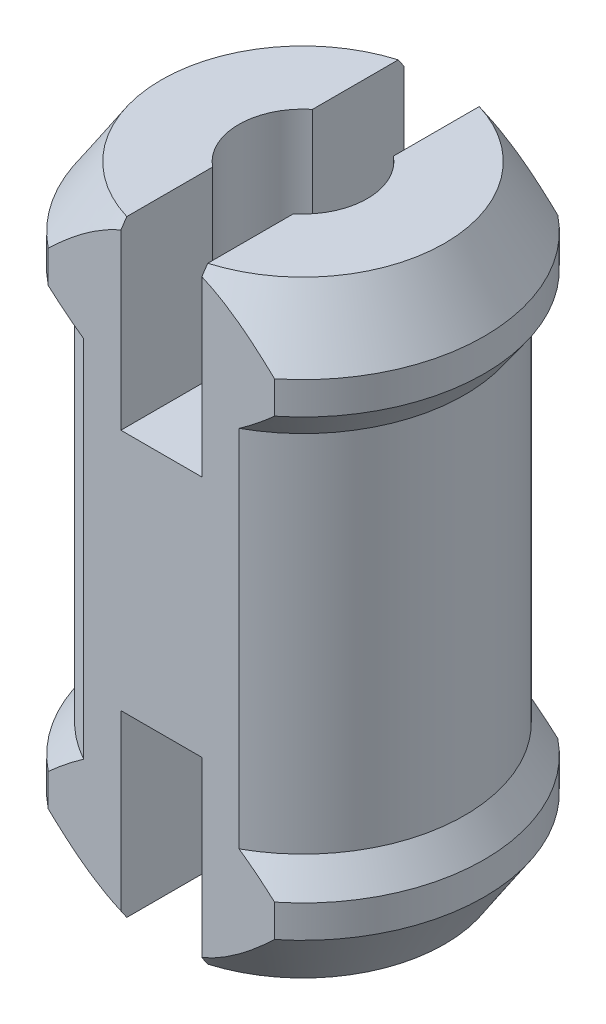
ISO-10303-21;
HEADER;
FILE_DESCRIPTION(('STEP AP214'),'2;1');
FILE_NAME('part.step','',(''),(''),'','','');
FILE_SCHEMA(('AUTOMOTIVE_DESIGN { 1 0 10303 214 1 1 1 1 }'));
ENDSEC;
DATA;
#1=APPLICATION_CONTEXT('core data for automotive mechanical design processes');
#2=APPLICATION_PROTOCOL_DEFINITION('international standard','automotive_design',2000,#1);
#3=PRODUCT_CONTEXT('',#1,'mechanical');
#4=PRODUCT('Part','Part','',(#3));
#5=PRODUCT_RELATED_PRODUCT_CATEGORY('part','',(#4));
#6=PRODUCT_DEFINITION_FORMATION('','',#4);
#7=PRODUCT_DEFINITION_CONTEXT('part definition',#1,'design');
#8=PRODUCT_DEFINITION('design','',#6,#7);
#9=PRODUCT_DEFINITION_SHAPE('','',#8);
#10=(LENGTH_UNIT() NAMED_UNIT(*) SI_UNIT(.MILLI.,.METRE.));
#11=(NAMED_UNIT(*) PLANE_ANGLE_UNIT() SI_UNIT($,.RADIAN.));
#12=(NAMED_UNIT(*) SI_UNIT($,.STERADIAN.) SOLID_ANGLE_UNIT());
#13=UNCERTAINTY_MEASURE_WITH_UNIT(LENGTH_MEASURE(1.E-05),#10,'distance_accuracy_value','');
#14=(GEOMETRIC_REPRESENTATION_CONTEXT(3) GLOBAL_UNCERTAINTY_ASSIGNED_CONTEXT((#13)) GLOBAL_UNIT_ASSIGNED_CONTEXT((#10,
#11,#12)) REPRESENTATION_CONTEXT('',''));
#15=CARTESIAN_POINT('',(0.,0.,0.));
#16=DIRECTION('',(0.,0.,1.));
#17=DIRECTION('',(1.,0.,0.));
#18=AXIS2_PLACEMENT_3D('',#15,#16,#17);
#19=CARTESIAN_POINT('',(0.,5.50000000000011,20.5359784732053));
#20=DIRECTION('',(0.,-1.,0.));
#21=DIRECTION('',(0.,0.,1.));
#22=AXIS2_PLACEMENT_3D('',#19,#20,#21);
#23=CYLINDRICAL_SURFACE('',#22,1.58900472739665);
#24=CARTESIAN_POINT('',(0.,1.00000000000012,20.5359784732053));
#25=DIRECTION('',(0.,1.,0.));
#26=DIRECTION('',(0.,0.,1.));
#27=AXIS2_PLACEMENT_3D('',#24,#25,#26);
#28=CIRCLE('',#27,1.58900472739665);
#29=CARTESIAN_POINT('',(1.,1.00000000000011,21.7708614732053));
#30=VERTEX_POINT('',#29);
#31=CARTESIAN_POINT('',(1.,1.00000000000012,19.3010954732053));
#32=VERTEX_POINT('',#31);
#33=EDGE_CURVE('E261',#30,#32,#28,.T.);
#34=ORIENTED_EDGE('',*,*,#33,.F.);
#35=DIRECTION('',(0.,-1.,0.));
#36=VECTOR('',#35,1.);
#37=CARTESIAN_POINT('',(1.,5.50000000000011,21.7708614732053));
#38=LINE('',#37,#36);
#39=CARTESIAN_POINT('',(1.,5.50000000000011,21.7708614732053));
#40=VERTEX_POINT('',#39);
#41=EDGE_CURVE('E670',#30,#40,#38,.F.);
#42=ORIENTED_EDGE('',*,*,#41,.T.);
#43=CARTESIAN_POINT('',(0.,5.50000000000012,20.5359784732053));
#44=DIRECTION('',(0.,1.,0.));
#45=DIRECTION('',(0.,0.,1.));
#46=AXIS2_PLACEMENT_3D('',#43,#44,#45);
#47=CIRCLE('',#46,1.58900472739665);
#48=CARTESIAN_POINT('',(1.,5.50000000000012,19.3010954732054));
#49=VERTEX_POINT('',#48);
#50=EDGE_CURVE('E269',#40,#49,#47,.T.);
#51=ORIENTED_EDGE('',*,*,#50,.T.);
#52=DIRECTION('',(0.,-1.,0.));
#53=VECTOR('',#52,1.);
#54=CARTESIAN_POINT('',(1.,5.50000000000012,19.3010954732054));
#55=LINE('',#54,#53);
#56=EDGE_CURVE('E667',#49,#32,#55,.T.);
#57=ORIENTED_EDGE('',*,*,#56,.T.);
#58=EDGE_LOOP('',(#34,#42,#51,#57));
#59=FACE_BOUND('',#58,.T.);
#60=ADVANCED_FACE('F32',(#59),#23,.F.);
#61=CARTESIAN_POINT('',(0.,1.00000000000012,17.0359786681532));
#62=DIRECTION('',(0.,1.,0.));
#63=DIRECTION('',(0.,0.,-1.));
#64=AXIS2_PLACEMENT_3D('',#61,#62,#63);
#65=PLANE('',#64);
#66=CARTESIAN_POINT('',(0.,1.00000000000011,20.5359784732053));
#67=DIRECTION('',(0.,1.,0.));
#68=DIRECTION('',(0.,0.,1.));
#69=AXIS2_PLACEMENT_3D('',#66,#67,#68);
#70=CIRCLE('',#69,3.49999980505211);
#71=CARTESIAN_POINT('',(1.,1.00000000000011,23.8900802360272));
#72=VERTEX_POINT('',#71);
#73=CARTESIAN_POINT('',(1.,1.00000000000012,17.1818767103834));
#74=VERTEX_POINT('',#73);
#75=EDGE_CURVE('E265',#72,#74,#70,.T.);
#76=ORIENTED_EDGE('',*,*,#75,.F.);
#77=DIRECTION('',(0.,0.,-1.));
#78=VECTOR('',#77,1.);
#79=CARTESIAN_POINT('',(1.,1.00000000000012,17.0359786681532));
#80=LINE('',#79,#78);
#81=EDGE_CURVE('E11',#72,#30,#80,.T.);
#82=ORIENTED_EDGE('',*,*,#81,.T.);
#83=ORIENTED_EDGE('',*,*,#33,.T.);
#84=EDGE_CURVE('E37',#32,#74,#80,.T.);
#85=ORIENTED_EDGE('',*,*,#84,.T.);
#86=EDGE_LOOP('',(#76,#82,#83,#85));
#87=FACE_BOUND('',#86,.T.);
#88=ADVANCED_FACE('F409',(#87),#65,.F.);
#89=CARTESIAN_POINT('',(0.,11.5,20.5359784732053));
#90=DIRECTION('',(0.,1.,0.));
#91=DIRECTION('',(0.,0.,1.));
#92=AXIS2_PLACEMENT_3D('',#89,#90,#91);
#93=CYLINDRICAL_SURFACE('',#92,3.9917400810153);
#94=DIRECTION('',(0.,1.,0.));
#95=VECTOR('',#94,1.);
#96=CARTESIAN_POINT('',(1.91937200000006,11.5,24.0359784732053));
#97=LINE('',#96,#95);
#98=CARTESIAN_POINT('',(1.91937200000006,13.0000000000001,24.0359784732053));
#99=VERTEX_POINT('',#98);
#100=CARTESIAN_POINT('',(1.91937200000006,4.00000000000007,24.0359784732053));
#101=VERTEX_POINT('',#100);
#102=EDGE_CURVE('E513',#99,#101,#97,.F.);
#103=ORIENTED_EDGE('',*,*,#102,.T.);
#104=CARTESIAN_POINT('',(0.,4.00000000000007,20.5359784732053));
#105=DIRECTION('',(0.,1.,0.));
#106=DIRECTION('',(0.,0.,1.));
#107=AXIS2_PLACEMENT_3D('',#104,#105,#106);
#108=CIRCLE('',#107,3.9917400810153);
#109=CARTESIAN_POINT('',(1.91937199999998,4.00000000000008,17.0359784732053));
#110=VERTEX_POINT('',#109);
#111=EDGE_CURVE('E272',#101,#110,#108,.T.);
#112=ORIENTED_EDGE('',*,*,#111,.T.);
#113=DIRECTION('',(0.,1.,0.));
#114=VECTOR('',#113,1.);
#115=CARTESIAN_POINT('',(1.91937199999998,11.5,17.0359784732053));
#116=LINE('',#115,#114);
#117=CARTESIAN_POINT('',(1.91937199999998,13.0000000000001,17.0359784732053));
#118=VERTEX_POINT('',#117);
#119=EDGE_CURVE('E359',#110,#118,#116,.T.);
#120=ORIENTED_EDGE('',*,*,#119,.T.);
#121=CARTESIAN_POINT('',(0.,13.0000000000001,20.5359784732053));
#122=DIRECTION('',(0.,1.,0.));
#123=DIRECTION('',(0.,0.,1.));
#124=AXIS2_PLACEMENT_3D('',#121,#122,#123);
#125=CIRCLE('',#124,3.9917400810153);
#126=EDGE_CURVE('E522',#99,#118,#125,.T.);
#127=ORIENTED_EDGE('',*,*,#126,.F.);
#128=EDGE_LOOP('',(#103,#112,#120,#127));
#129=FACE_BOUND('',#128,.T.);
#130=ADVANCED_FACE('F335',(#129),#93,.T.);
#131=CARTESIAN_POINT('',(-1.91937199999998,4.00000000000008,17.0359784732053));
#132=VERTEX_POINT('',#131);
#133=CARTESIAN_POINT('',(-1.91937200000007,4.00000000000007,24.0359784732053));
#134=VERTEX_POINT('',#133);
#135=EDGE_CURVE('E273',#132,#134,#108,.T.);
#136=ORIENTED_EDGE('',*,*,#135,.T.);
#137=DIRECTION('',(0.,1.,0.));
#138=VECTOR('',#137,1.);
#139=CARTESIAN_POINT('',(-1.91937200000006,11.5,24.0359784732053));
#140=LINE('',#139,#138);
#141=CARTESIAN_POINT('',(-1.91937200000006,13.0000000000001,24.0359784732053));
#142=VERTEX_POINT('',#141);
#143=EDGE_CURVE('E524',#134,#142,#140,.T.);
#144=ORIENTED_EDGE('',*,*,#143,.T.);
#145=CARTESIAN_POINT('',(-1.91937199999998,13.0000000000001,17.0359784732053));
#146=VERTEX_POINT('',#145);
#147=EDGE_CURVE('E526',#146,#142,#125,.T.);
#148=ORIENTED_EDGE('',*,*,#147,.F.);
#149=DIRECTION('',(0.,1.,0.));
#150=VECTOR('',#149,1.);
#151=CARTESIAN_POINT('',(-1.91937199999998,11.5,17.0359784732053));
#152=LINE('',#151,#150);
#153=EDGE_CURVE('E360',#146,#132,#152,.F.);
#154=ORIENTED_EDGE('',*,*,#153,.T.);
#155=EDGE_LOOP('',(#136,#144,#148,#154));
#156=FACE_BOUND('',#155,.T.);
#157=ADVANCED_FACE('F642',(#156),#93,.T.);
#158=CARTESIAN_POINT('',(0.,2.5000000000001,20.5359784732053));
#159=DIRECTION('',(0.,1.,0.));
#160=DIRECTION('',(0.,0.,-1.));
#161=AXIS2_PLACEMENT_3D('',#158,#159,#160);
#162=CONICAL_SURFACE('',#161,4.48005192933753,0.578739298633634);
#163=CARTESIAN_POINT('',(-6.3795156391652,6.78013073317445,17.0359784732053));
#164=CARTESIAN_POINT('',(-6.24091982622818,6.59418573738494,17.0359784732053));
#165=CARTESIAN_POINT('',(-6.1016775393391,6.40871797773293,17.0359784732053));
#166=CARTESIAN_POINT('',(-5.82156279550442,6.03898412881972,17.0359784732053));
#167=CARTESIAN_POINT('',(-5.68069014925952,5.85471818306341,17.0359784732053));
#168=CARTESIAN_POINT('',(-5.39632323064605,5.48679055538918,17.0359784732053));
#169=CARTESIAN_POINT('',(-5.25281956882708,5.3031361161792,17.0359784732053));
#170=CARTESIAN_POINT('',(-4.96341707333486,4.93773903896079,17.0359784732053));
#171=CARTESIAN_POINT('',(-4.81751838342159,4.75599628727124,17.0359784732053));
#172=CARTESIAN_POINT('',(-4.51404117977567,4.3843078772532,17.0359784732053));
#173=CARTESIAN_POINT('',(-4.35628104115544,4.19450996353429,17.0359784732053));
#174=CARTESIAN_POINT('',(-4.03645217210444,3.81859127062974,17.0359784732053));
#175=CARTESIAN_POINT('',(-3.8743837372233,3.63247024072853,17.0359784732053));
#176=CARTESIAN_POINT('',(-3.54489251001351,3.2656536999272,17.0359784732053));
#177=CARTESIAN_POINT('',(-3.37748114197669,3.08494803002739,17.0359784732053));
#178=CARTESIAN_POINT('',(-3.12066436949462,2.81945528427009,17.0359784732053));
#179=CARTESIAN_POINT('',(-3.03412316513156,2.73189892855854,17.0359784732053));
#180=CARTESIAN_POINT('',(-2.85879142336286,2.55907268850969,17.0359784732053));
#181=CARTESIAN_POINT('',(-2.77000103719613,2.47380265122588,17.0359784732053));
#182=CARTESIAN_POINT('',(-2.57797485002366,2.29512593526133,17.0359784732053));
#183=CARTESIAN_POINT('',(-2.47436907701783,2.20211449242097,17.0359784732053));
#184=CARTESIAN_POINT('',(-2.2630121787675,2.02080332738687,17.0359784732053));
#185=CARTESIAN_POINT('',(-2.15525939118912,1.93250552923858,17.0359784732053));
#186=CARTESIAN_POINT('',(-1.93551736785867,1.76283150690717,17.0359784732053));
#187=CARTESIAN_POINT('',(-1.82356072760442,1.681413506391,17.0359784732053));
#188=CARTESIAN_POINT('',(-1.59389857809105,1.52720819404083,17.0359784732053));
#189=CARTESIAN_POINT('',(-1.47619740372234,1.45441451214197,17.0359784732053));
#190=CARTESIAN_POINT('',(-1.22135366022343,1.31356878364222,17.0359784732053));
#191=CARTESIAN_POINT('',(-1.08346995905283,1.24682678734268,17.0359784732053));
#192=CARTESIAN_POINT('',(-0.79934088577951,1.13395665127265,17.0359784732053));
#193=CARTESIAN_POINT('',(-0.653108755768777,1.08779683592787,17.0359784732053));
#194=CARTESIAN_POINT('',(-0.428227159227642,1.0387185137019,17.0359784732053));
#195=CARTESIAN_POINT('',(-0.35173907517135,1.02569932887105,17.0359784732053));
#196=CARTESIAN_POINT('',(-0.197835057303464,1.00726974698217,17.0359784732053));
#197=CARTESIAN_POINT('',(-0.120419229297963,1.00185849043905,17.0359784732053));
#198=CARTESIAN_POINT('',(0.0344884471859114,0.99894933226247,17.0359784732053));
#199=CARTESIAN_POINT('',(0.111980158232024,1.00144408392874,17.0359784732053));
#200=CARTESIAN_POINT('',(0.266321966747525,1.01419068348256,17.0359784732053));
#201=CARTESIAN_POINT('',(0.343171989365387,1.02444342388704,17.0359784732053));
#202=CARTESIAN_POINT('',(0.499961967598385,1.05299063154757,17.0359784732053));
#203=CARTESIAN_POINT('',(0.579822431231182,1.07171724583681,17.0359784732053));
#204=CARTESIAN_POINT('',(0.737518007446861,1.11635136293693,17.0359784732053));
#205=CARTESIAN_POINT('',(0.815352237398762,1.14226193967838,17.0359784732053));
#206=CARTESIAN_POINT('',(0.968907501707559,1.20030284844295,17.0359784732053));
#207=CARTESIAN_POINT('',(1.04462149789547,1.23245160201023,17.0359784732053));
#208=CARTESIAN_POINT('',(1.19362190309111,1.3019054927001,17.0359784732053));
#209=CARTESIAN_POINT('',(1.26690830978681,1.33921063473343,17.0359784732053));
#210=CARTESIAN_POINT('',(1.42623898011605,1.42634533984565,17.0359784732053));
#211=CARTESIAN_POINT('',(1.51174094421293,1.47716169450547,17.0359784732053));
#212=CARTESIAN_POINT('',(1.67961687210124,1.58374702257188,17.0359784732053));
#213=CARTESIAN_POINT('',(1.76198952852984,1.63951803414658,17.0359784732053));
#214=CARTESIAN_POINT('',(1.92404092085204,1.75507663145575,17.0359784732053));
#215=CARTESIAN_POINT('',(2.00371534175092,1.81487023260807,17.0359784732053));
#216=CARTESIAN_POINT('',(2.16058826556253,1.93762571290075,17.0359784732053));
#217=CARTESIAN_POINT('',(2.23778644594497,2.00058800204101,17.0359784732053));
#218=CARTESIAN_POINT('',(2.39101224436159,2.1299217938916,17.0359784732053));
#219=CARTESIAN_POINT('',(2.46701108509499,2.19632725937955,17.0359784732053));
#220=CARTESIAN_POINT('',(2.61706817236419,2.3312927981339,17.0359784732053));
#221=CARTESIAN_POINT('',(2.69112636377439,2.39985293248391,17.0359784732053));
#222=CARTESIAN_POINT('',(2.83747166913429,2.53868075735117,17.0359784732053));
#223=CARTESIAN_POINT('',(2.90976057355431,2.6089465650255,17.0359784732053));
#224=CARTESIAN_POINT('',(3.05285374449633,2.7509640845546,17.0359784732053));
#225=CARTESIAN_POINT('',(3.12365807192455,2.82271573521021,17.0359784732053));
#226=CARTESIAN_POINT('',(3.35729287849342,3.06373418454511,17.0359784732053));
#227=CARTESIAN_POINT('',(3.51726834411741,3.23577073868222,17.0359784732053));
#228=CARTESIAN_POINT('',(3.8319884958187,3.58457836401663,17.0359784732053));
#229=CARTESIAN_POINT('',(3.98673216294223,3.76135034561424,17.0359784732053));
#230=CARTESIAN_POINT('',(4.29226741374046,4.1184464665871,17.0359784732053));
#231=CARTESIAN_POINT('',(4.4430566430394,4.29877261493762,17.0359784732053));
#232=CARTESIAN_POINT('',(4.74146802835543,4.66202852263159,17.0359784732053));
#233=CARTESIAN_POINT('',(4.88909007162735,4.84495837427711,17.0359784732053));
#234=CARTESIAN_POINT('',(5.18222638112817,5.21336134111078,17.0359784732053));
#235=CARTESIAN_POINT('',(5.32773330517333,5.39884028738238,17.0359784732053));
#236=CARTESIAN_POINT('',(5.61668093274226,5.77140243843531,17.0359784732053));
#237=CARTESIAN_POINT('',(5.76012160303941,5.95848566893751,17.0359784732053));
#238=CARTESIAN_POINT('',(6.18781057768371,6.52151642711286,17.0359784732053));
#239=CARTESIAN_POINT('',(6.46953356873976,6.89938167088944,17.0359784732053));
#240=CARTESIAN_POINT('',(6.99494181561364,7.61327357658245,17.0359784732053));
#241=CARTESIAN_POINT('',(7.23915525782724,7.94891345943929,17.0359784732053));
#242=CARTESIAN_POINT('',(7.72483262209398,8.62222865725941,17.0359784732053));
#243=CARTESIAN_POINT('',(7.9662962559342,8.95990418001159,17.0359784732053));
#244=CARTESIAN_POINT('',(8.44575751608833,9.6349071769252,17.0359784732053));
#245=CARTESIAN_POINT('',(8.68376691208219,9.97222630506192,17.0359784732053));
#246=CARTESIAN_POINT('',(9.1580543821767,10.6480140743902,17.0359784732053));
#247=CARTESIAN_POINT('',(9.39433267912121,10.986482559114,17.0359784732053));
#248=CARTESIAN_POINT('',(9.62996940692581,11.3253941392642,17.0359784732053));
#249=B_SPLINE_CURVE_WITH_KNOTS('',3,(#163,#164,#165,#166,#167,#168,#169,#170,#171,#172,#173,
#174,#175,#176,#177,#178,#179,#180,#181,#182,#183,#184,#185,#186,#187,#188,#189,#190,#191,#192,
#193,#194,#195,#196,#197,#198,#199,#200,#201,#202,#203,#204,#205,#206,#207,#208,#209,#210,#211,
#212,#213,#214,#215,#216,#217,#218,#219,#220,#221,#222,#223,#224,#225,#226,#227,#228,#229,#230,
#231,#232,#233,#234,#235,#236,#237,#238,#239,#240,#241,#242,#243,#244,#245,#246,#247,#248),
.UNSPECIFIED.,.F.,.F.,(4,2,2,2,2,2,2,2,2,2,2,2,2,2,2,2,2,2,2,2,2,2,2,2,2,2,2,2,2,2,2,2,2,2,2,2,
2,2,2,2,2,2,4),(0.,0.695747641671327,1.39157689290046,2.09077440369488,2.78993009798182,
3.53028680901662,4.27059286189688,5.00941000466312,5.37870011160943,5.74796545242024,
6.16554774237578,6.58329920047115,6.99829783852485,7.4129880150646,7.87141966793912,
8.32914334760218,8.56157992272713,8.79399023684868,9.02618464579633,9.25840577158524,
9.5041030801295,9.74990568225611,9.99644550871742,10.2429855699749,10.541155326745,
10.8394483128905,11.138197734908,11.4369859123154,11.7397064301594,12.0424355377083,
12.3448444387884,12.647240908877,13.351837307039,14.0565701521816,14.761713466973,
15.4668818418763,16.1740923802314,16.8813142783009,18.2952361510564,19.5404725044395,
20.7858381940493,22.0243375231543,23.2626745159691),.UNSPECIFIED.);
#250=CARTESIAN_POINT('',(-1.,1.21435871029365,17.0359784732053));
#251=VERTEX_POINT('',#250);
#252=CARTESIAN_POINT('',(-2.79658099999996,2.5000000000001,17.0359784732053));
#253=VERTEX_POINT('',#252);
#254=EDGE_CURVE('E495',#251,#253,#249,.F.);
#255=ORIENTED_EDGE('',*,*,#254,.F.);
#256=CARTESIAN_POINT('',(-0.999999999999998,6.795546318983,13.3182987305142));
#257=CARTESIAN_POINT('',(-0.999999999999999,6.48146307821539,13.525479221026));
#258=CARTESIAN_POINT('',(-0.999999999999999,6.16744974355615,13.7327659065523));
#259=CARTESIAN_POINT('',(-0.999999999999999,5.53962002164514,14.1476528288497));
#260=CARTESIAN_POINT('',(-0.999999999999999,5.22580363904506,14.3552530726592));
#261=CARTESIAN_POINT('',(-0.999999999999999,4.5980150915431,14.7711398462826));
#262=CARTESIAN_POINT('',(-0.999999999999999,4.28404328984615,14.9794269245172));
#263=CARTESIAN_POINT('',(-0.999999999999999,3.65648121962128,15.396561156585));
#264=CARTESIAN_POINT('',(-0.999999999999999,3.34289094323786,15.6054082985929));
#265=CARTESIAN_POINT('',(-0.999999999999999,2.68958704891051,16.0417247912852));
#266=CARTESIAN_POINT('',(-0.999999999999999,2.34992159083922,16.2692662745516));
#267=CARTESIAN_POINT('',(-0.999999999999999,1.67156778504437,16.7258523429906));
#268=CARTESIAN_POINT('',(-0.999999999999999,1.33287950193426,16.9548970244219));
#269=CARTESIAN_POINT('',(-0.999999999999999,0.826347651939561,17.3002842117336));
#270=CARTESIAN_POINT('',(-0.999999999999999,0.657842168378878,17.415655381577));
#271=CARTESIAN_POINT('',(-0.999999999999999,0.321449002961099,17.6472942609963));
#272=CARTESIAN_POINT('',(-0.999999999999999,0.153561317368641,17.7635619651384));
#273=CARTESIAN_POINT('',(-0.999999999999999,-0.181309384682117,17.9973552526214));
#274=CARTESIAN_POINT('',(-0.999999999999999,-0.348292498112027,18.1148806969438));
#275=CARTESIAN_POINT('',(-0.999999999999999,-0.68092161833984,18.3518063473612));
#276=CARTESIAN_POINT('',(-0.999999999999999,-0.846567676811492,18.471206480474));
#277=CARTESIAN_POINT('',(-0.999999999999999,-1.07630932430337,18.64002047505));
#278=CARTESIAN_POINT('',(-0.999999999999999,-1.14133635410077,18.6881660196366));
#279=CARTESIAN_POINT('',(-0.999999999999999,-1.27095144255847,18.7850498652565));
#280=CARTESIAN_POINT('',(-0.999999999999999,-1.33553948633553,18.8337881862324));
#281=CARTESIAN_POINT('',(-0.999999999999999,-1.46425548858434,18.9320775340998));
#282=CARTESIAN_POINT('',(-0.999999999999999,-1.52838256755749,18.9816297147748));
#283=CARTESIAN_POINT('',(-0.999999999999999,-1.65589614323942,19.0816704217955));
#284=CARTESIAN_POINT('',(-0.999999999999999,-1.71928269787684,19.1321588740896));
#285=CARTESIAN_POINT('',(-0.999999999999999,-1.84429347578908,19.2337312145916));
#286=CARTESIAN_POINT('',(-0.999999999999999,-1.90592978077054,19.2848001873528));
#287=CARTESIAN_POINT('',(-0.999999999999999,-2.02785578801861,19.3885189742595));
#288=CARTESIAN_POINT('',(-0.999999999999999,-2.08814563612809,19.4411686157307));
#289=CARTESIAN_POINT('',(-0.999999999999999,-2.20664216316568,19.5485193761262));
#290=CARTESIAN_POINT('',(-0.999999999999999,-2.26485306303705,19.6032158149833));
#291=CARTESIAN_POINT('',(-0.999999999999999,-2.37827301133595,19.7156195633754));
#292=CARTESIAN_POINT('',(-0.999999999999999,-2.4334844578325,19.7733243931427));
#293=CARTESIAN_POINT('',(-0.999999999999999,-2.50500319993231,19.8546114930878));
#294=CARTESIAN_POINT('',(-0.999999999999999,-2.52349305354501,19.8762694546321));
#295=CARTESIAN_POINT('',(-0.999999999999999,-2.55968003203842,19.9202403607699));
#296=CARTESIAN_POINT('',(-0.999999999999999,-2.57737706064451,19.9425533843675));
#297=CARTESIAN_POINT('',(-0.999999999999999,-2.62910374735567,20.0107257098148));
#298=CARTESIAN_POINT('',(-0.999999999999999,-2.66168159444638,20.0577215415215));
#299=CARTESIAN_POINT('',(-0.999999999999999,-2.72124204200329,20.1563363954));
#300=CARTESIAN_POINT('',(-0.999999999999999,-2.7481217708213,20.2080196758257));
#301=CARTESIAN_POINT('',(-0.999999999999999,-2.7915405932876,20.3155302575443));
#302=CARTESIAN_POINT('',(-0.999999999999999,-2.80814007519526,20.3713311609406));
#303=CARTESIAN_POINT('',(-0.999999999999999,-2.82372833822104,20.466418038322));
#304=CARTESIAN_POINT('',(-0.999999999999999,-2.82673443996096,20.5050356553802));
#305=CARTESIAN_POINT('',(-0.999999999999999,-2.82582997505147,20.5821882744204));
#306=CARTESIAN_POINT('',(-0.999999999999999,-2.82191945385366,20.6207232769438));
#307=CARTESIAN_POINT('',(-0.999999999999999,-2.8061980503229,20.7051126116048));
#308=CARTESIAN_POINT('',(-0.999999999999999,-2.7928083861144,20.7506643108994));
#309=CARTESIAN_POINT('',(-0.999999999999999,-2.758932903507,20.8390558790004));
#310=CARTESIAN_POINT('',(-0.999999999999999,-2.73842560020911,20.8818870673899));
#311=CARTESIAN_POINT('',(-0.999999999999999,-2.68742980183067,20.974140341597));
#312=CARTESIAN_POINT('',(-0.999999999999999,-2.65573374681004,21.0228774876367));
#313=CARTESIAN_POINT('',(-0.999999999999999,-2.58779117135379,21.1171159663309));
#314=CARTESIAN_POINT('',(-0.999999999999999,-2.55153516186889,21.1626102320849));
#315=CARTESIAN_POINT('',(-0.999999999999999,-2.47582161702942,21.2514004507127));
#316=CARTESIAN_POINT('',(-0.999999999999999,-2.43634240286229,21.2946776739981));
#317=CARTESIAN_POINT('',(-0.999999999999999,-2.35541960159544,21.379246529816));
#318=CARTESIAN_POINT('',(-0.999999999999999,-2.31397809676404,21.4205401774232));
#319=CARTESIAN_POINT('',(-0.999999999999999,-2.22536259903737,21.5057999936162));
#320=CARTESIAN_POINT('',(-0.999999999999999,-2.17803616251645,21.5496067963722));
#321=CARTESIAN_POINT('',(-0.999999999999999,-2.08215026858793,21.6358540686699));
#322=CARTESIAN_POINT('',(-0.999999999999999,-2.03359063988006,21.6782943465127));
#323=CARTESIAN_POINT('',(-0.999999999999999,-1.88651841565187,21.8040811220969));
#324=CARTESIAN_POINT('',(-0.999999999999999,-1.78665965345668,21.8858495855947));
#325=CARTESIAN_POINT('',(-0.999999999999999,-1.58463903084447,22.0468835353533));
#326=CARTESIAN_POINT('',(-1.,-1.48247289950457,22.1261435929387));
#327=CARTESIAN_POINT('',(-1.,-1.2767871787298,22.2828193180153));
#328=CARTESIAN_POINT('',(-1.,-1.17326800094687,22.3602355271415));
#329=CARTESIAN_POINT('',(-1.,-0.96548792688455,22.5136271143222));
#330=CARTESIAN_POINT('',(-1.,-0.861228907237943,22.5896050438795));
#331=CARTESIAN_POINT('',(-1.,-0.65202013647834,22.7406186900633));
#332=CARTESIAN_POINT('',(-1.,-0.547070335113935,22.8156543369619));
#333=CARTESIAN_POINT('',(-1.,-0.23172084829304,23.039518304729));
#334=CARTESIAN_POINT('',(-1.,-0.020569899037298,23.1872870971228));
#335=CARTESIAN_POINT('',(-1.,0.464093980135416,23.5235577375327));
#336=CARTESIAN_POINT('',(-1.,0.737998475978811,23.7114930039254));
#337=CARTESIAN_POINT('',(-1.,1.28695937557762,24.0856816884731));
#338=CARTESIAN_POINT('',(-1.,1.56201580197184,24.2719350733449));
#339=CARTESIAN_POINT('',(-1.,2.11301015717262,24.6434549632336));
#340=CARTESIAN_POINT('',(-1.,2.38894848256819,24.8287208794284));
#341=CARTESIAN_POINT('',(-1.,2.94131823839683,25.198511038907));
#342=CARTESIAN_POINT('',(-1.,3.21774966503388,25.3830352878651));
#343=CARTESIAN_POINT('',(-1.,3.76905181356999,25.7502837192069));
#344=CARTESIAN_POINT('',(-1.,4.04392012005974,25.9330115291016));
#345=CARTESIAN_POINT('',(-1.,4.59391201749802,26.2980839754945));
#346=CARTESIAN_POINT('',(-1.,4.86903560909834,26.4804286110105));
#347=CARTESIAN_POINT('',(-1.,5.41930614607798,26.8447159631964));
#348=CARTESIAN_POINT('',(-1.,5.69445297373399,27.0266588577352));
#349=CARTESIAN_POINT('',(-1.,6.24489688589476,27.3903152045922));
#350=CARTESIAN_POINT('',(-1.,6.5201939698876,27.5720286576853));
#351=CARTESIAN_POINT('',(-1.,6.795546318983,27.7536582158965));
#352=B_SPLINE_CURVE_WITH_KNOTS('',3,(#256,#257,#258,#259,#260,#261,#262,#263,#264,#265,#266,
#267,#268,#269,#270,#271,#272,#273,#274,#275,#276,#277,#278,#279,#280,#281,#282,#283,#284,#285,
#286,#287,#288,#289,#290,#291,#292,#293,#294,#295,#296,#297,#298,#299,#300,#301,#302,#303,#304,
#305,#306,#307,#308,#309,#310,#311,#312,#313,#314,#315,#316,#317,#318,#319,#320,#321,#322,#323,
#324,#325,#326,#327,#328,#329,#330,#331,#332,#333,#334,#335,#336,#337,#338,#339,#340,#341,#342,
#343,#344,#345,#346,#347,#348,#349,#350,#351),.UNSPECIFIED.,.F.,.F.,(4,2,2,2,2,2,2,2,2,2,2,2,2,
2,2,2,2,2,2,2,2,2,2,2,2,2,2,2,2,2,2,2,2,2,2,2,2,2,2,2,2,2,2,2,2,2,2,4),(0.,1.12878195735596,
2.25758964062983,3.38792379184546,4.51823426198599,5.7447437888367,6.97133263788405,
7.58398194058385,8.19662753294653,8.80920609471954,9.42176086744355,9.66448981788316,
9.90722695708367,10.1503444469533,10.3934427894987,10.6335572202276,10.8736455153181,
11.1132148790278,11.3525897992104,11.438004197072,11.5234289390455,11.694668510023,
11.8687766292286,12.0418520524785,12.157460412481,12.2730680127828,12.4146717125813,
12.5567066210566,12.7306944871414,12.9050505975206,13.0806951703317,13.2561573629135,
13.4495879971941,13.6430456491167,14.0301542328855,14.4180501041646,14.8058305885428,
15.1928425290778,15.5798829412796,16.3530307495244,17.3495600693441,18.3461090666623,
19.3431975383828,20.3402783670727,21.3304690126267,22.3206621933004,23.3102483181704,
24.2998310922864),.UNSPECIFIED.);
#353=CARTESIAN_POINT('',(-0.999999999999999,1.00000000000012,17.1818767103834));
#354=VERTEX_POINT('',#353);
#355=EDGE_CURVE('E659',#251,#354,#352,.T.);
#356=ORIENTED_EDGE('',*,*,#355,.T.);
#357=CARTESIAN_POINT('',(-1.,1.00000000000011,23.8900802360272));
#358=VERTEX_POINT('',#357);
#359=EDGE_CURVE('E262',#354,#358,#70,.T.);
#360=ORIENTED_EDGE('',*,*,#359,.T.);
#361=CARTESIAN_POINT('',(-1.,1.21435871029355,24.0359784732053));
#362=VERTEX_POINT('',#361);
#363=EDGE_CURVE('E48',#358,#362,#352,.T.);
#364=ORIENTED_EDGE('',*,*,#363,.T.);
#365=CARTESIAN_POINT('',(-6.3795156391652,6.78013073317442,24.0359784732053));
#366=CARTESIAN_POINT('',(-6.24091982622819,6.5941857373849,24.0359784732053));
#367=CARTESIAN_POINT('',(-6.10167753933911,6.4087179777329,24.0359784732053));
#368=CARTESIAN_POINT('',(-5.82156279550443,6.03898412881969,24.0359784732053));
#369=CARTESIAN_POINT('',(-5.68069014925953,5.85471818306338,24.0359784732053));
#370=CARTESIAN_POINT('',(-5.39632323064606,5.48679055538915,24.0359784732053));
#371=CARTESIAN_POINT('',(-5.25281956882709,5.30313611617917,24.0359784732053));
#372=CARTESIAN_POINT('',(-4.96341707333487,4.93773903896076,24.0359784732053));
#373=CARTESIAN_POINT('',(-4.8175183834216,4.75599628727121,24.0359784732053));
#374=CARTESIAN_POINT('',(-4.51404117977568,4.38430787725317,24.0359784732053));
#375=CARTESIAN_POINT('',(-4.35628104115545,4.19450996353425,24.0359784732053));
#376=CARTESIAN_POINT('',(-4.03645217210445,3.81859127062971,24.0359784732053));
#377=CARTESIAN_POINT('',(-3.87438373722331,3.6324702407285,24.0359784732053));
#378=CARTESIAN_POINT('',(-3.54489251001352,3.26565369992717,24.0359784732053));
#379=CARTESIAN_POINT('',(-3.37748114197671,3.08494803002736,24.0359784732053));
#380=CARTESIAN_POINT('',(-3.12066436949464,2.81945528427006,24.0359784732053));
#381=CARTESIAN_POINT('',(-3.03412316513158,2.73189892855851,24.0359784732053));
#382=CARTESIAN_POINT('',(-2.85879142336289,2.55907268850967,24.0359784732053));
#383=CARTESIAN_POINT('',(-2.77000103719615,2.47380265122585,24.0359784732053));
#384=CARTESIAN_POINT('',(-2.57797485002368,2.2951259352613,24.0359784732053));
#385=CARTESIAN_POINT('',(-2.47436907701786,2.20211449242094,24.0359784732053));
#386=CARTESIAN_POINT('',(-2.26301217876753,2.02080332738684,24.0359784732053));
#387=CARTESIAN_POINT('',(-2.15525939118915,1.93250552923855,24.0359784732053));
#388=CARTESIAN_POINT('',(-1.9355173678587,1.76283150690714,24.0359784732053));
#389=CARTESIAN_POINT('',(-1.82356072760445,1.68141350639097,24.0359784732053));
#390=CARTESIAN_POINT('',(-1.59389857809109,1.5272081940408,24.0359784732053));
#391=CARTESIAN_POINT('',(-1.47619740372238,1.45441451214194,24.0359784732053));
#392=CARTESIAN_POINT('',(-1.22135366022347,1.31356878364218,24.0359784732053));
#393=CARTESIAN_POINT('',(-1.08346995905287,1.24682678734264,24.0359784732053));
#394=CARTESIAN_POINT('',(-0.799340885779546,1.1339566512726,24.0359784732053));
#395=CARTESIAN_POINT('',(-0.653108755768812,1.08779683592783,24.0359784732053));
#396=CARTESIAN_POINT('',(-0.428227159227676,1.03871851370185,24.0359784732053));
#397=CARTESIAN_POINT('',(-0.351739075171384,1.025699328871,24.0359784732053));
#398=CARTESIAN_POINT('',(-0.197835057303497,1.00726974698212,24.0359784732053));
#399=CARTESIAN_POINT('',(-0.120419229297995,1.00185849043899,24.0359784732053));
#400=CARTESIAN_POINT('',(0.0344884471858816,0.998949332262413,24.0359784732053));
#401=CARTESIAN_POINT('',(0.111980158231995,1.00144408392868,24.0359784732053));
#402=CARTESIAN_POINT('',(0.266321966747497,1.0141906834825,24.0359784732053));
#403=CARTESIAN_POINT('',(0.34317198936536,1.02444342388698,24.0359784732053));
#404=CARTESIAN_POINT('',(0.499961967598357,1.0529906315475,24.0359784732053));
#405=CARTESIAN_POINT('',(0.579822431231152,1.07171724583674,24.0359784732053));
#406=CARTESIAN_POINT('',(0.737518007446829,1.11635136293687,24.0359784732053));
#407=CARTESIAN_POINT('',(0.815352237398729,1.14226193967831,24.0359784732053));
#408=CARTESIAN_POINT('',(0.968907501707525,1.20030284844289,24.0359784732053));
#409=CARTESIAN_POINT('',(1.04462149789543,1.23245160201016,24.0359784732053));
#410=CARTESIAN_POINT('',(1.19362190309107,1.30190549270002,24.0359784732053));
#411=CARTESIAN_POINT('',(1.26690830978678,1.33921063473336,24.0359784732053));
#412=CARTESIAN_POINT('',(1.426238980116,1.42634533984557,24.0359784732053));
#413=CARTESIAN_POINT('',(1.51174094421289,1.47716169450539,24.0359784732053));
#414=CARTESIAN_POINT('',(1.67961687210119,1.5837470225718,24.0359784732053));
#415=CARTESIAN_POINT('',(1.76198952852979,1.63951803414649,24.0359784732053));
#416=CARTESIAN_POINT('',(1.92404092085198,1.75507663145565,24.0359784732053));
#417=CARTESIAN_POINT('',(2.00371534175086,1.81487023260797,24.0359784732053));
#418=CARTESIAN_POINT('',(2.16058826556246,1.93762571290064,24.0359784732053));
#419=CARTESIAN_POINT('',(2.2377864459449,2.0005880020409,24.0359784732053));
#420=CARTESIAN_POINT('',(2.39101224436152,2.12992179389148,24.0359784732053));
#421=CARTESIAN_POINT('',(2.46701108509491,2.19632725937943,24.0359784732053));
#422=CARTESIAN_POINT('',(2.61706817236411,2.33129279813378,24.0359784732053));
#423=CARTESIAN_POINT('',(2.69112636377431,2.39985293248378,24.0359784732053));
#424=CARTESIAN_POINT('',(2.8374716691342,2.53868075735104,24.0359784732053));
#425=CARTESIAN_POINT('',(2.90976057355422,2.60894656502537,24.0359784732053));
#426=CARTESIAN_POINT('',(3.05285374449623,2.75096408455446,24.0359784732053));
#427=CARTESIAN_POINT('',(3.12365807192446,2.82271573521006,24.0359784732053));
#428=CARTESIAN_POINT('',(3.35729287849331,3.06373418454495,24.0359784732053));
#429=CARTESIAN_POINT('',(3.5172683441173,3.23577073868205,24.0359784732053));
#430=CARTESIAN_POINT('',(3.83198849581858,3.58457836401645,24.0359784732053));
#431=CARTESIAN_POINT('',(3.9867321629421,3.76135034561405,24.0359784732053));
#432=CARTESIAN_POINT('',(4.29226741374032,4.11844646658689,24.0359784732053));
#433=CARTESIAN_POINT('',(4.44305664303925,4.2987726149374,24.0359784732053));
#434=CARTESIAN_POINT('',(4.74146802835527,4.66202852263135,24.0359784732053));
#435=CARTESIAN_POINT('',(4.88909007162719,4.84495837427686,24.0359784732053));
#436=CARTESIAN_POINT('',(5.182226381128,5.21336134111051,24.0359784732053));
#437=CARTESIAN_POINT('',(5.32773330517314,5.39884028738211,24.0359784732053));
#438=CARTESIAN_POINT('',(5.61668093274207,5.77140243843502,24.0359784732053));
#439=CARTESIAN_POINT('',(5.76012160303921,5.95848566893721,24.0359784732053));
#440=CARTESIAN_POINT('',(6.1878105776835,6.52151642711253,24.0359784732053));
#441=CARTESIAN_POINT('',(6.46953356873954,6.8993816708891,24.0359784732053));
#442=CARTESIAN_POINT('',(6.99494181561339,7.61327357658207,24.0359784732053));
#443=CARTESIAN_POINT('',(7.23915525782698,7.9489134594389,24.0359784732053));
#444=CARTESIAN_POINT('',(7.7248326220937,8.62222865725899,24.0359784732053));
#445=CARTESIAN_POINT('',(7.96629625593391,8.95990418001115,24.0359784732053));
#446=CARTESIAN_POINT('',(8.44575751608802,9.63490717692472,24.0359784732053));
#447=CARTESIAN_POINT('',(8.68376691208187,9.97222630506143,24.0359784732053));
#448=CARTESIAN_POINT('',(9.15805438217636,10.6480140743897,24.0359784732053));
#449=CARTESIAN_POINT('',(9.39433267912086,10.9864825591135,24.0359784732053));
#450=CARTESIAN_POINT('',(9.62996940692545,11.3253941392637,24.0359784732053));
#451=B_SPLINE_CURVE_WITH_KNOTS('',3,(#365,#366,#367,#368,#369,#370,#371,#372,#373,#374,#375,
#376,#377,#378,#379,#380,#381,#382,#383,#384,#385,#386,#387,#388,#389,#390,#391,#392,#393,#394,
#395,#396,#397,#398,#399,#400,#401,#402,#403,#404,#405,#406,#407,#408,#409,#410,#411,#412,#413,
#414,#415,#416,#417,#418,#419,#420,#421,#422,#423,#424,#425,#426,#427,#428,#429,#430,#431,#432,
#433,#434,#435,#436,#437,#438,#439,#440,#441,#442,#443,#444,#445,#446,#447,#448,#449,#450),
.UNSPECIFIED.,.F.,.F.,(4,2,2,2,2,2,2,2,2,2,2,2,2,2,2,2,2,2,2,2,2,2,2,2,2,2,2,2,2,2,2,2,2,2,2,2,
2,2,2,2,2,2,4),(0.,0.695747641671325,1.39157689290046,2.09077440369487,2.78993009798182,
3.53028680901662,4.27059286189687,5.00941000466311,5.37870011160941,5.74796545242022,
6.16554774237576,6.58329920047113,6.99829783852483,7.41298801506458,7.8714196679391,
8.32914334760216,8.56157992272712,8.79399023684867,9.02618464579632,9.25840577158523,
9.50410308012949,9.7499056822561,9.9964455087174,10.2429855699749,10.5411553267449,
10.8394483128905,11.138197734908,11.4369859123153,11.7397064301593,12.0424355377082,
12.3448444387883,12.6472409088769,13.3518373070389,14.0565701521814,14.7617134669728,
15.466881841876,16.1740923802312,16.8813142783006,18.295236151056,19.5404725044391,
20.7858381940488,22.0243375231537,23.2626745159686),.UNSPECIFIED.);
#452=CARTESIAN_POINT('',(-2.796581,2.5000000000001,24.0359784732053));
#453=VERTEX_POINT('',#452);
#454=EDGE_CURVE('E465',#453,#362,#451,.T.);
#455=ORIENTED_EDGE('',*,*,#454,.F.);
#456=CARTESIAN_POINT('',(0.,2.5000000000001,20.5359784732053));
#457=DIRECTION('',(0.,1.,0.));
#458=DIRECTION('',(0.,0.,1.));
#459=AXIS2_PLACEMENT_3D('',#456,#457,#458);
#460=CIRCLE('',#459,4.48005192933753);
#461=EDGE_CURVE('E281',#253,#453,#460,.T.);
#462=ORIENTED_EDGE('',*,*,#461,.F.);
#463=EDGE_LOOP('',(#255,#356,#360,#364,#455,#462));
#464=FACE_BOUND('',#463,.T.);
#465=ADVANCED_FACE('F304',(#464),#162,.T.);
#466=CARTESIAN_POINT('',(1.,1.21435871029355,24.0359784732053));
#467=VERTEX_POINT('',#466);
#468=CARTESIAN_POINT('',(2.796581,2.50000000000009,24.0359784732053));
#469=VERTEX_POINT('',#468);
#470=EDGE_CURVE('E470',#467,#469,#451,.T.);
#471=ORIENTED_EDGE('',*,*,#470,.F.);
#472=CARTESIAN_POINT('',(1.,6.795546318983,27.7536582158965));
#473=CARTESIAN_POINT('',(1.,6.48146307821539,27.5464777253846));
#474=CARTESIAN_POINT('',(1.,6.16744974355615,27.3391910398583));
#475=CARTESIAN_POINT('',(1.,5.53962002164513,26.924304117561));
#476=CARTESIAN_POINT('',(1.,5.22580363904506,26.7167038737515));
#477=CARTESIAN_POINT('',(1.,4.5980150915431,26.3008171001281));
#478=CARTESIAN_POINT('',(1.,4.28404328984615,26.0925300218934));
#479=CARTESIAN_POINT('',(1.,3.65648121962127,25.6753957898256));
#480=CARTESIAN_POINT('',(1.,3.34289094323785,25.4665486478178));
#481=CARTESIAN_POINT('',(1.,2.6895870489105,25.0302321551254));
#482=CARTESIAN_POINT('',(1.,2.34992159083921,24.8026906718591));
#483=CARTESIAN_POINT('',(1.,1.67156778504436,24.34610460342));
#484=CARTESIAN_POINT('',(1.,1.33287950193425,24.1170599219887));
#485=CARTESIAN_POINT('',(1.,0.826347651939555,23.771672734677));
#486=CARTESIAN_POINT('',(1.,0.657842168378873,23.6563015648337));
#487=CARTESIAN_POINT('',(1.,0.321449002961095,23.4246626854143));
#488=CARTESIAN_POINT('',(1.,0.153561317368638,23.3083949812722));
#489=CARTESIAN_POINT('',(1.,-0.181309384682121,23.0746016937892));
#490=CARTESIAN_POINT('',(1.,-0.348292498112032,22.9570762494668));
#491=CARTESIAN_POINT('',(1.,-0.680921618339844,22.7201505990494));
#492=CARTESIAN_POINT('',(1.,-0.846567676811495,22.6007504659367));
#493=CARTESIAN_POINT('',(1.,-1.07630932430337,22.4319364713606));
#494=CARTESIAN_POINT('',(1.,-1.14133635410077,22.383790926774));
#495=CARTESIAN_POINT('',(1.,-1.27095144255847,22.2869070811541));
#496=CARTESIAN_POINT('',(1.,-1.33553948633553,22.2381687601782));
#497=CARTESIAN_POINT('',(1.,-1.46425548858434,22.1398794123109));
#498=CARTESIAN_POINT('',(1.,-1.52838256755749,22.0903272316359));
#499=CARTESIAN_POINT('',(1.,-1.65589614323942,21.9902865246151));
#500=CARTESIAN_POINT('',(1.,-1.71928269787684,21.939798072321));
#501=CARTESIAN_POINT('',(1.,-1.84429347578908,21.838225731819));
#502=CARTESIAN_POINT('',(1.,-1.90592978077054,21.7871567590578));
#503=CARTESIAN_POINT('',(1.,-2.02785578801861,21.6834379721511));
#504=CARTESIAN_POINT('',(1.,-2.08814563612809,21.6307883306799));
#505=CARTESIAN_POINT('',(1.,-2.20664216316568,21.5234375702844));
#506=CARTESIAN_POINT('',(1.,-2.26485306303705,21.4687411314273));
#507=CARTESIAN_POINT('',(1.,-2.37827301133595,21.3563373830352));
#508=CARTESIAN_POINT('',(1.,-2.4334844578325,21.2986325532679));
#509=CARTESIAN_POINT('',(1.,-2.50500319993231,21.2173454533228));
#510=CARTESIAN_POINT('',(1.,-2.52349305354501,21.1956874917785));
#511=CARTESIAN_POINT('',(1.,-2.55968003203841,21.1517165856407));
#512=CARTESIAN_POINT('',(1.,-2.57737706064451,21.1294035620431));
#513=CARTESIAN_POINT('',(1.,-2.62910374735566,21.0612312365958));
#514=CARTESIAN_POINT('',(1.,-2.66168159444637,21.0142354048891));
#515=CARTESIAN_POINT('',(1.,-2.72124204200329,20.9156205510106));
#516=CARTESIAN_POINT('',(1.,-2.7481217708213,20.8639372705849));
#517=CARTESIAN_POINT('',(1.,-2.7915405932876,20.7564266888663));
#518=CARTESIAN_POINT('',(1.,-2.80814007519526,20.70062578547));
#519=CARTESIAN_POINT('',(1.,-2.82372833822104,20.6055389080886));
#520=CARTESIAN_POINT('',(1.,-2.82673443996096,20.5669212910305));
#521=CARTESIAN_POINT('',(1.,-2.82582997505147,20.4897686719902));
#522=CARTESIAN_POINT('',(1.,-2.82191945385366,20.4512336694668));
#523=CARTESIAN_POINT('',(1.,-2.8061980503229,20.3668443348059));
#524=CARTESIAN_POINT('',(1.,-2.7928083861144,20.3212926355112));
#525=CARTESIAN_POINT('',(1.,-2.758932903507,20.2329010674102));
#526=CARTESIAN_POINT('',(1.,-2.73842560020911,20.1900698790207));
#527=CARTESIAN_POINT('',(1.,-2.68742980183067,20.0978166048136));
#528=CARTESIAN_POINT('',(1.,-2.65573374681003,20.0490794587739));
#529=CARTESIAN_POINT('',(1.,-2.58779117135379,19.9548409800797));
#530=CARTESIAN_POINT('',(1.,-2.55153516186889,19.9093467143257));
#531=CARTESIAN_POINT('',(1.,-2.47582161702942,19.8205564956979));
#532=CARTESIAN_POINT('',(1.,-2.43634240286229,19.7772792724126));
#533=CARTESIAN_POINT('',(1.,-2.35541960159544,19.6927104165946));
#534=CARTESIAN_POINT('',(1.,-2.31397809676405,19.6514167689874));
#535=CARTESIAN_POINT('',(1.,-2.22536259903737,19.5661569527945));
#536=CARTESIAN_POINT('',(1.,-2.17803616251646,19.5223501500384));
#537=CARTESIAN_POINT('',(1.,-2.08215026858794,19.4361028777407));
#538=CARTESIAN_POINT('',(1.,-2.03359063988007,19.3936625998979));
#539=CARTESIAN_POINT('',(1.,-1.88651841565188,19.2678758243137));
#540=CARTESIAN_POINT('',(1.,-1.7866596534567,19.1861073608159));
#541=CARTESIAN_POINT('',(1.,-1.58463903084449,19.0250734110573));
#542=CARTESIAN_POINT('',(1.,-1.4824728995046,18.945813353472));
#543=CARTESIAN_POINT('',(1.,-1.27678717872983,18.7891376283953));
#544=CARTESIAN_POINT('',(1.,-1.1732680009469,18.7117214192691));
#545=CARTESIAN_POINT('',(1.,-0.965487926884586,18.5583298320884));
#546=CARTESIAN_POINT('',(1.,-0.86122890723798,18.4823519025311));
#547=CARTESIAN_POINT('',(1.,-0.65202013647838,18.3313382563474));
#548=CARTESIAN_POINT('',(1.,-0.547070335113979,18.2563026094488));
#549=CARTESIAN_POINT('',(1.,-0.231720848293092,18.0324386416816));
#550=CARTESIAN_POINT('',(1.,-0.0205698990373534,17.8846698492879));
#551=CARTESIAN_POINT('',(1.,0.464093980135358,17.548399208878));
#552=CARTESIAN_POINT('',(1.,0.737998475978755,17.3604639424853));
#553=CARTESIAN_POINT('',(1.,1.28695937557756,16.9862752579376));
#554=CARTESIAN_POINT('',(1.,1.56201580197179,16.8000218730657));
#555=CARTESIAN_POINT('',(1.,2.11301015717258,16.4285019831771));
#556=CARTESIAN_POINT('',(1.,2.38894848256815,16.2432360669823));
#557=CARTESIAN_POINT('',(1.,2.9413182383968,15.8734459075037));
#558=CARTESIAN_POINT('',(1.,3.21774966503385,15.6889216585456));
#559=CARTESIAN_POINT('',(1.,3.76905181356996,15.3216732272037));
#560=CARTESIAN_POINT('',(1.,4.04392012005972,15.138945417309));
#561=CARTESIAN_POINT('',(1.,4.59391201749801,14.7738729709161));
#562=CARTESIAN_POINT('',(1.,4.86903560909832,14.5915283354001));
#563=CARTESIAN_POINT('',(1.,5.41930614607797,14.2272409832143));
#564=CARTESIAN_POINT('',(1.,5.69445297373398,14.0452980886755));
#565=CARTESIAN_POINT('',(1.,6.24489688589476,13.6816417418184));
#566=CARTESIAN_POINT('',(1.,6.5201939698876,13.4999282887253));
#567=CARTESIAN_POINT('',(1.,6.795546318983,13.3182987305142));
#568=B_SPLINE_CURVE_WITH_KNOTS('',3,(#472,#473,#474,#475,#476,#477,#478,#479,#480,#481,#482,
#483,#484,#485,#486,#487,#488,#489,#490,#491,#492,#493,#494,#495,#496,#497,#498,#499,#500,#501,
#502,#503,#504,#505,#506,#507,#508,#509,#510,#511,#512,#513,#514,#515,#516,#517,#518,#519,#520,
#521,#522,#523,#524,#525,#526,#527,#528,#529,#530,#531,#532,#533,#534,#535,#536,#537,#538,#539,
#540,#541,#542,#543,#544,#545,#546,#547,#548,#549,#550,#551,#552,#553,#554,#555,#556,#557,#558,
#559,#560,#561,#562,#563,#564,#565,#566,#567),.UNSPECIFIED.,.F.,.F.,(4,2,2,2,2,2,2,2,2,2,2,2,2,
2,2,2,2,2,2,2,2,2,2,2,2,2,2,2,2,2,2,2,2,2,2,2,2,2,2,2,2,2,2,2,2,2,2,4),(0.,1.12878195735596,
2.25758964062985,3.38792379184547,4.51823426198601,5.74474378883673,6.97133263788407,
7.58398194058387,8.19662753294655,8.80920609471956,9.42176086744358,9.66448981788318,
9.90722695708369,10.1503444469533,10.3934427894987,10.6335572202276,10.8736455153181,
11.1132148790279,11.3525897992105,11.438004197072,11.5234289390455,11.694668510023,
11.8687766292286,12.0418520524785,12.157460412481,12.2730680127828,12.4146717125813,
12.5567066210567,12.7306944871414,12.9050505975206,13.0806951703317,13.2561573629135,
13.4495879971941,13.6430456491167,14.0301542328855,14.4180501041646,14.8058305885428,
15.1928425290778,15.5798829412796,16.3530307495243,17.3495600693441,18.3461090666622,
19.3431975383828,20.3402783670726,21.3304690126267,22.3206621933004,23.3102483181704,
24.2998310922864),.UNSPECIFIED.);
#569=EDGE_CURVE('E674',#467,#72,#568,.T.);
#570=ORIENTED_EDGE('',*,*,#569,.T.);
#571=ORIENTED_EDGE('',*,*,#75,.T.);
#572=CARTESIAN_POINT('',(1.,1.21435871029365,17.0359784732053));
#573=VERTEX_POINT('',#572);
#574=EDGE_CURVE('E492',#74,#573,#568,.T.);
#575=ORIENTED_EDGE('',*,*,#574,.T.);
#576=CARTESIAN_POINT('',(2.79658099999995,2.50000000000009,17.0359784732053));
#577=VERTEX_POINT('',#576);
#578=EDGE_CURVE('E490',#577,#573,#249,.F.);
#579=ORIENTED_EDGE('',*,*,#578,.F.);
#580=EDGE_CURVE('E280',#469,#577,#460,.T.);
#581=ORIENTED_EDGE('',*,*,#580,.F.);
#582=EDGE_LOOP('',(#471,#570,#571,#575,#579,#581));
#583=FACE_BOUND('',#582,.T.);
#584=ADVANCED_FACE('F487',(#583),#162,.T.);
#585=CARTESIAN_POINT('',(0.,5.50000000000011,20.5359784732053));
#586=DIRECTION('',(0.,-1.,0.));
#587=DIRECTION('',(0.,0.,1.));
#588=AXIS2_PLACEMENT_3D('',#585,#586,#587);
#589=CYLINDRICAL_SURFACE('',#588,4.48005192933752);
#590=DIRECTION('',(0.,-1.,0.));
#591=VECTOR('',#590,1.);
#592=CARTESIAN_POINT('',(-2.796581,5.50000000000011,24.0359784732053));
#593=LINE('',#592,#591);
#594=CARTESIAN_POINT('',(-2.796581,3.3000000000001,24.0359784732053));
#595=VERTEX_POINT('',#594);
#596=EDGE_CURVE('E453',#595,#453,#593,.T.);
#597=ORIENTED_EDGE('',*,*,#596,.F.);
#598=CARTESIAN_POINT('',(0.,3.3000000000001,20.5359784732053));
#599=DIRECTION('',(0.,1.,0.));
#600=DIRECTION('',(0.,0.,1.));
#601=AXIS2_PLACEMENT_3D('',#598,#599,#600);
#602=CIRCLE('',#601,4.48005192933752);
#603=CARTESIAN_POINT('',(-2.79658099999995,3.3000000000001,17.0359784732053));
#604=VERTEX_POINT('',#603);
#605=EDGE_CURVE('E277',#604,#595,#602,.T.);
#606=ORIENTED_EDGE('',*,*,#605,.F.);
#607=DIRECTION('',(0.,-1.,0.));
#608=VECTOR('',#607,1.);
#609=CARTESIAN_POINT('',(-2.79658099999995,5.50000000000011,17.0359784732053));
#610=LINE('',#609,#608);
#611=EDGE_CURVE('E498',#253,#604,#610,.F.);
#612=ORIENTED_EDGE('',*,*,#611,.F.);
#613=ORIENTED_EDGE('',*,*,#461,.T.);
#614=EDGE_LOOP('',(#597,#606,#612,#613));
#615=FACE_BOUND('',#614,.T.);
#616=ADVANCED_FACE('F435',(#615),#589,.T.);
#617=DIRECTION('',(0.,-1.,0.));
#618=VECTOR('',#617,1.);
#619=CARTESIAN_POINT('',(2.796581,5.50000000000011,24.0359784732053));
#620=LINE('',#619,#618);
#621=CARTESIAN_POINT('',(2.796581,3.3000000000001,24.0359784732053));
#622=VERTEX_POINT('',#621);
#623=EDGE_CURVE('E471',#469,#622,#620,.F.);
#624=ORIENTED_EDGE('',*,*,#623,.F.);
#625=ORIENTED_EDGE('',*,*,#580,.T.);
#626=DIRECTION('',(0.,-1.,0.));
#627=VECTOR('',#626,1.);
#628=CARTESIAN_POINT('',(2.79658099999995,5.50000000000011,17.0359784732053));
#629=LINE('',#628,#627);
#630=CARTESIAN_POINT('',(2.79658099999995,3.30000000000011,17.0359784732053));
#631=VERTEX_POINT('',#630);
#632=EDGE_CURVE('E496',#631,#577,#629,.T.);
#633=ORIENTED_EDGE('',*,*,#632,.F.);
#634=EDGE_CURVE('E276',#622,#631,#602,.T.);
#635=ORIENTED_EDGE('',*,*,#634,.F.);
#636=EDGE_LOOP('',(#624,#625,#633,#635));
#637=FACE_BOUND('',#636,.T.);
#638=ADVANCED_FACE('F433',(#637),#589,.T.);
#639=CARTESIAN_POINT('',(0.,4.00000000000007,20.5359784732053));
#640=DIRECTION('',(0.,-1.,0.));
#641=DIRECTION('',(0.,0.,1.));
#642=AXIS2_PLACEMENT_3D('',#639,#640,#641);
#643=CONICAL_SURFACE('',#642,3.99174008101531,0.609105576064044);
#644=CARTESIAN_POINT('',(7.46182746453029,-2.09264341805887,24.0359784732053));
#645=CARTESIAN_POINT('',(7.28263259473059,-1.86012094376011,24.0359784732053));
#646=CARTESIAN_POINT('',(7.10274390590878,-1.62812748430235,24.0359784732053));
#647=CARTESIAN_POINT('',(6.7411495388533,-1.16552577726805,24.0359784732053));
#648=CARTESIAN_POINT('',(6.55944368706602,-0.934917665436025,24.0359784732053));
#649=CARTESIAN_POINT('',(6.19389173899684,-0.475548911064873,24.0359784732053));
#650=CARTESIAN_POINT('',(6.01004650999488,-0.24678757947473,24.0359784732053));
#651=CARTESIAN_POINT('',(5.63956121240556,0.208452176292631,24.0359784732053));
#652=CARTESIAN_POINT('',(5.45292125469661,0.434930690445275,24.0359784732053));
#653=CARTESIAN_POINT('',(5.13565171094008,0.813669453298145,24.0359784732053));
#654=CARTESIAN_POINT('',(5.00598697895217,0.966737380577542,24.0359784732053));
#655=CARTESIAN_POINT('',(4.74460964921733,1.27111312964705,24.0359784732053));
#656=CARTESIAN_POINT('',(4.61289709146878,1.42242098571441,24.0359784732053));
#657=CARTESIAN_POINT('',(4.34683324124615,1.72297673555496,24.0359784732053));
#658=CARTESIAN_POINT('',(4.21247941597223,1.87222239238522,24.0359784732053));
#659=CARTESIAN_POINT('',(3.9406697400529,2.16785574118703,24.0359784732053));
#660=CARTESIAN_POINT('',(3.803214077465,2.31424360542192,24.0359784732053));
#661=CARTESIAN_POINT('',(3.53462078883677,2.59265483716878,24.0359784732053));
#662=CARTESIAN_POINT('',(3.40375971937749,2.72494401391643,24.0359784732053));
#663=CARTESIAN_POINT('',(3.13779047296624,2.98527051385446,24.0359784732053));
#664=CARTESIAN_POINT('',(3.00268130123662,3.11330682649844,24.0359784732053));
#665=CARTESIAN_POINT('',(2.72722040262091,3.36342884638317,24.0359784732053));
#666=CARTESIAN_POINT('',(2.58687302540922,3.48551930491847,24.0359784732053));
#667=CARTESIAN_POINT('',(2.29941339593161,3.7213884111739,24.0359784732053));
#668=CARTESIAN_POINT('',(2.15230506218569,3.8351717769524,24.0359784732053));
#669=CARTESIAN_POINT('',(1.84364227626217,4.05478346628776,24.0359784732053));
#670=CARTESIAN_POINT('',(1.68175198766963,4.16014867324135,24.0359784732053));
#671=CARTESIAN_POINT('',(1.34648940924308,4.35095225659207,24.0359784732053));
#672=CARTESIAN_POINT('',(1.17313272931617,4.43641703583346,24.0359784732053));
#673=CARTESIAN_POINT('',(0.852676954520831,4.56179172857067,24.0359784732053));
#674=CARTESIAN_POINT('',(0.707957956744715,4.60754752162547,24.0359784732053));
#675=CARTESIAN_POINT('',(0.486839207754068,4.65768932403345,24.0359784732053));
#676=CARTESIAN_POINT('',(0.412502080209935,4.67131882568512,24.0359784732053));
#677=CARTESIAN_POINT('',(0.262892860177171,4.69191050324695,24.0359784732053));
#678=CARTESIAN_POINT('',(0.187620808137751,4.69887296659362,24.0359784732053));
#679=CARTESIAN_POINT('',(0.0363281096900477,4.70582182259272,24.0359784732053));
#680=CARTESIAN_POINT('',(-0.039694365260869,4.70576870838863,24.0359784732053));
#681=CARTESIAN_POINT('',(-0.191400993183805,4.69859325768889,24.0359784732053));
#682=CARTESIAN_POINT('',(-0.267085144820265,4.69147089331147,24.0359784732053));
#683=CARTESIAN_POINT('',(-0.417563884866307,4.67047575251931,24.0359784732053));
#684=CARTESIAN_POINT('',(-0.492357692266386,4.65659744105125,24.0359784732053));
#685=CARTESIAN_POINT('',(-0.640539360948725,4.62266320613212,24.0359784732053));
#686=CARTESIAN_POINT('',(-0.71392668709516,4.60260497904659,24.0359784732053));
#687=CARTESIAN_POINT('',(-0.888528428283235,4.54773141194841,24.0359784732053));
#688=CARTESIAN_POINT('',(-0.988899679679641,4.51023315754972,24.0359784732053));
#689=CARTESIAN_POINT('',(-1.18589769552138,4.4264548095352,24.0359784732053));
#690=CARTESIAN_POINT('',(-1.28252228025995,4.38016969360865,24.0359784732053));
#691=CARTESIAN_POINT('',(-1.47246092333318,4.28046653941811,24.0359784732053));
#692=CARTESIAN_POINT('',(-1.56576061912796,4.22702141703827,24.0359784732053));
#693=CARTESIAN_POINT('',(-1.74892369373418,4.11464732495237,24.0359784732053));
#694=CARTESIAN_POINT('',(-1.83878805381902,4.0557199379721,24.0359784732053));
#695=CARTESIAN_POINT('',(-2.0758825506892,3.89180333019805,24.0359784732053));
#696=CARTESIAN_POINT('',(-2.22036274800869,3.78284813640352,24.0359784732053));
#697=CARTESIAN_POINT('',(-2.50262576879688,3.55652645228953,24.0359784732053));
#698=CARTESIAN_POINT('',(-2.64040355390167,3.43915379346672,24.0359784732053));
#699=CARTESIAN_POINT('',(-2.91095942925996,3.19816406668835,24.0359784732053));
#700=CARTESIAN_POINT('',(-3.0437243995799,3.07453236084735,24.0359784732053));
#701=CARTESIAN_POINT('',(-3.30497684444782,2.82293050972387,24.0359784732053));
#702=CARTESIAN_POINT('',(-3.43346551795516,2.69496160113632,24.0359784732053));
#703=CARTESIAN_POINT('',(-3.68790119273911,2.43486037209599,24.0359784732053));
#704=CARTESIAN_POINT('',(-3.81382555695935,2.3027059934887,24.0359784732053));
#705=CARTESIAN_POINT('',(-4.06290690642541,2.03580797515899,24.0359784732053));
#706=CARTESIAN_POINT('',(-4.18606372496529,1.90106418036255,24.0359784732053));
#707=CARTESIAN_POINT('',(-4.42993277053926,1.62973316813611,24.0359784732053));
#708=CARTESIAN_POINT('',(-4.55064822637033,1.49314884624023,24.0359784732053));
#709=CARTESIAN_POINT('',(-4.79020301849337,1.21834299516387,24.0359784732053));
#710=CARTESIAN_POINT('',(-4.90904231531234,1.08012143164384,24.0359784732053));
#711=CARTESIAN_POINT('',(-5.23880856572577,0.692175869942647,24.0359784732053));
#712=CARTESIAN_POINT('',(-5.44800318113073,0.440979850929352,24.0359784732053));
#713=CARTESIAN_POINT('',(-5.8627350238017,-0.0645714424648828,24.0359784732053));
#714=CARTESIAN_POINT('',(-6.06827072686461,-0.318927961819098,24.0359784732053));
#715=CARTESIAN_POINT('',(-6.47305819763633,-0.825637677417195,24.0359784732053));
#716=CARTESIAN_POINT('',(-6.67235754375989,-1.07795293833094,24.0359784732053));
#717=CARTESIAN_POINT('',(-7.06865342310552,-1.58418577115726,24.0359784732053));
#718=CARTESIAN_POINT('',(-7.26565104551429,-1.83810248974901,24.0359784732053));
#719=CARTESIAN_POINT('',(-7.46182746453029,-2.09264341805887,24.0359784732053));
#720=B_SPLINE_CURVE_WITH_KNOTS('',3,(#644,#645,#646,#647,#648,#649,#650,#651,#652,#653,#654,
#655,#656,#657,#658,#659,#660,#661,#662,#663,#664,#665,#666,#667,#668,#669,#670,#671,#672,#673,
#674,#675,#676,#677,#678,#679,#680,#681,#682,#683,#684,#685,#686,#687,#688,#689,#690,#691,#692,
#693,#694,#695,#696,#697,#698,#699,#700,#701,#702,#703,#704,#705,#706,#707,#708,#709,#710,#711,
#712,#713,#714,#715,#716,#717,#718,#719),.UNSPECIFIED.,.F.,.F.,(4,2,2,2,2,2,2,2,2,2,2,2,2,2,2,2,
2,2,2,2,2,2,2,2,2,2,2,2,2,2,2,2,2,2,2,2,2,4),(0.,0.880685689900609,1.76145631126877,
2.64188152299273,3.52227189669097,4.12407551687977,4.72586739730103,5.32826760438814,
5.93063138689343,6.4887925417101,7.04708538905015,7.60492453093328,8.16244433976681,
8.74103293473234,9.31884945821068,9.77229117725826,9.99876007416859,10.2252192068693,
10.4529536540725,10.6806889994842,10.9086112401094,11.1366185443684,11.4575122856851,
11.7785899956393,12.1009184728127,12.4231541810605,12.9655262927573,13.5083000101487,
14.0524076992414,14.5963615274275,15.143939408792,15.6915501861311,16.2383818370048,
16.7852249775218,17.765861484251,18.7468973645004,19.7114816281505,20.6755892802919),.UNSPECIFIED.);
#721=EDGE_CURVE('E455',#622,#101,#720,.T.);
#722=ORIENTED_EDGE('',*,*,#721,.F.);
#723=ORIENTED_EDGE('',*,*,#634,.T.);
#724=CARTESIAN_POINT('',(-7.46182746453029,-2.09264341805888,17.0359784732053));
#725=CARTESIAN_POINT('',(-7.28263259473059,-1.86012094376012,17.0359784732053));
#726=CARTESIAN_POINT('',(-7.10274390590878,-1.62812748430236,17.0359784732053));
#727=CARTESIAN_POINT('',(-6.74114953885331,-1.16552577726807,17.0359784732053));
#728=CARTESIAN_POINT('',(-6.55944368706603,-0.934917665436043,17.0359784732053));
#729=CARTESIAN_POINT('',(-6.19389173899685,-0.475548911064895,17.0359784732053));
#730=CARTESIAN_POINT('',(-6.01004650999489,-0.246787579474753,17.0359784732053));
#731=CARTESIAN_POINT('',(-5.63956121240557,0.208452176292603,17.0359784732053));
#732=CARTESIAN_POINT('',(-5.45292125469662,0.434930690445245,17.0359784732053));
#733=CARTESIAN_POINT('',(-5.1356517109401,0.813669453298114,17.0359784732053));
#734=CARTESIAN_POINT('',(-5.00598697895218,0.966737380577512,17.0359784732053));
#735=CARTESIAN_POINT('',(-4.74460964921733,1.27111312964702,17.0359784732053));
#736=CARTESIAN_POINT('',(-4.61289709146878,1.42242098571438,17.0359784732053));
#737=CARTESIAN_POINT('',(-4.34683324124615,1.72297673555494,17.0359784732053));
#738=CARTESIAN_POINT('',(-4.21247941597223,1.87222239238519,17.0359784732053));
#739=CARTESIAN_POINT('',(-3.9406697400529,2.167855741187,17.0359784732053));
#740=CARTESIAN_POINT('',(-3.803214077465,2.3142436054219,17.0359784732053));
#741=CARTESIAN_POINT('',(-3.53462078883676,2.59265483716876,17.0359784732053));
#742=CARTESIAN_POINT('',(-3.40375971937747,2.72494401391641,17.0359784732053));
#743=CARTESIAN_POINT('',(-3.13779047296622,2.98527051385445,17.0359784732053));
#744=CARTESIAN_POINT('',(-3.00268130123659,3.11330682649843,17.0359784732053));
#745=CARTESIAN_POINT('',(-2.72722040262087,3.36342884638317,17.0359784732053));
#746=CARTESIAN_POINT('',(-2.58687302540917,3.48551930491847,17.0359784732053));
#747=CARTESIAN_POINT('',(-2.29941339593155,3.7213884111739,17.0359784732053));
#748=CARTESIAN_POINT('',(-2.15230506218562,3.8351717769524,17.0359784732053));
#749=CARTESIAN_POINT('',(-1.84364227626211,4.05478346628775,17.0359784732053));
#750=CARTESIAN_POINT('',(-1.68175198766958,4.16014867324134,17.0359784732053));
#751=CARTESIAN_POINT('',(-1.34648940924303,4.35095225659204,17.0359784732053));
#752=CARTESIAN_POINT('',(-1.17313272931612,4.43641703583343,17.0359784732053));
#753=CARTESIAN_POINT('',(-0.852676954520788,4.56179172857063,17.0359784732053));
#754=CARTESIAN_POINT('',(-0.70795795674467,4.60754752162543,17.0359784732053));
#755=CARTESIAN_POINT('',(-0.486839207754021,4.65768932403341,17.0359784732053));
#756=CARTESIAN_POINT('',(-0.412502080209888,4.67131882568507,17.0359784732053));
#757=CARTESIAN_POINT('',(-0.262892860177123,4.6919105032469,17.0359784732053));
#758=CARTESIAN_POINT('',(-0.187620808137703,4.69887296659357,17.0359784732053));
#759=CARTESIAN_POINT('',(-0.036328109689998,4.70582182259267,17.0359784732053));
#760=CARTESIAN_POINT('',(0.0396943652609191,4.70576870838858,17.0359784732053));
#761=CARTESIAN_POINT('',(0.191400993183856,4.69859325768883,17.0359784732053));
#762=CARTESIAN_POINT('',(0.267085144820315,4.69147089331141,17.0359784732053));
#763=CARTESIAN_POINT('',(0.417563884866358,4.67047575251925,17.0359784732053));
#764=CARTESIAN_POINT('',(0.492357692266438,4.65659744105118,17.0359784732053));
#765=CARTESIAN_POINT('',(0.640539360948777,4.62266320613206,17.0359784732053));
#766=CARTESIAN_POINT('',(0.713926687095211,4.60260497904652,17.0359784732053));
#767=CARTESIAN_POINT('',(0.888528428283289,4.54773141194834,17.0359784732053));
#768=CARTESIAN_POINT('',(0.988899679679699,4.51023315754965,17.0359784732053));
#769=CARTESIAN_POINT('',(1.18589769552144,4.42645480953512,17.0359784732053));
#770=CARTESIAN_POINT('',(1.28252228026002,4.38016969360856,17.0359784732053));
#771=CARTESIAN_POINT('',(1.47246092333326,4.28046653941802,17.0359784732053));
#772=CARTESIAN_POINT('',(1.56576061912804,4.22702141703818,17.0359784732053));
#773=CARTESIAN_POINT('',(1.74892369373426,4.11464732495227,17.0359784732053));
#774=CARTESIAN_POINT('',(1.8387880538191,4.055719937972,17.0359784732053));
#775=CARTESIAN_POINT('',(2.0758825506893,3.89180333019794,17.0359784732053));
#776=CARTESIAN_POINT('',(2.2203627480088,3.7828481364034,17.0359784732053));
#777=CARTESIAN_POINT('',(2.50262576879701,3.55652645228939,17.0359784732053));
#778=CARTESIAN_POINT('',(2.6404035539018,3.43915379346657,17.0359784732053));
#779=CARTESIAN_POINT('',(2.91095942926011,3.19816406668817,17.0359784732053));
#780=CARTESIAN_POINT('',(3.04372439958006,3.07453236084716,17.0359784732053));
#781=CARTESIAN_POINT('',(3.304976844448,2.82293050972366,17.0359784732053));
#782=CARTESIAN_POINT('',(3.43346551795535,2.6949616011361,17.0359784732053));
#783=CARTESIAN_POINT('',(3.68790119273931,2.43486037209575,17.0359784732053));
#784=CARTESIAN_POINT('',(3.81382555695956,2.30270599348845,17.0359784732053));
#785=CARTESIAN_POINT('',(4.06290690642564,2.03580797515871,17.0359784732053));
#786=CARTESIAN_POINT('',(4.18606372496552,1.90106418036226,17.0359784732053));
#787=CARTESIAN_POINT('',(4.42993277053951,1.62973316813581,17.0359784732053));
#788=CARTESIAN_POINT('',(4.55064822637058,1.49314884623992,17.0359784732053));
#789=CARTESIAN_POINT('',(4.79020301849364,1.21834299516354,17.0359784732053));
#790=CARTESIAN_POINT('',(4.90904231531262,1.0801214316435,17.0359784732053));
#791=CARTESIAN_POINT('',(5.23880856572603,0.692175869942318,17.0359784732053));
#792=CARTESIAN_POINT('',(5.44800318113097,0.440979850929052,17.0359784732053));
#793=CARTESIAN_POINT('',(5.86273502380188,-0.0645714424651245,17.0359784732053));
#794=CARTESIAN_POINT('',(6.06827072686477,-0.31892796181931,17.0359784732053));
#795=CARTESIAN_POINT('',(6.47305819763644,-0.825637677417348,17.0359784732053));
#796=CARTESIAN_POINT('',(6.67235754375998,-1.07795293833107,17.0359784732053));
#797=CARTESIAN_POINT('',(7.06865342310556,-1.58418577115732,17.0359784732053));
#798=CARTESIAN_POINT('',(7.26565104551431,-1.83810248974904,17.0359784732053));
#799=CARTESIAN_POINT('',(7.46182746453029,-2.09264341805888,17.0359784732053));
#800=B_SPLINE_CURVE_WITH_KNOTS('',3,(#724,#725,#726,#727,#728,#729,#730,#731,#732,#733,#734,
#735,#736,#737,#738,#739,#740,#741,#742,#743,#744,#745,#746,#747,#748,#749,#750,#751,#752,#753,
#754,#755,#756,#757,#758,#759,#760,#761,#762,#763,#764,#765,#766,#767,#768,#769,#770,#771,#772,
#773,#774,#775,#776,#777,#778,#779,#780,#781,#782,#783,#784,#785,#786,#787,#788,#789,#790,#791,
#792,#793,#794,#795,#796,#797,#798,#799),.UNSPECIFIED.,.F.,.F.,(4,2,2,2,2,2,2,2,2,2,2,2,2,2,2,2,
2,2,2,2,2,2,2,2,2,2,2,2,2,2,2,2,2,2,2,2,2,4),(0.,0.880685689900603,1.76145631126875,
2.64188152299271,3.52227189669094,4.12407551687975,4.72586739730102,5.32826760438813,
5.93063138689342,6.48879254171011,7.04708538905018,7.60492453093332,8.16244433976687,
8.74103293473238,9.3188494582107,9.77229117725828,9.99876007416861,10.2252192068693,
10.4529536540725,10.6806889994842,10.9086112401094,11.1366185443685,11.4575122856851,
11.7785899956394,12.1009184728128,12.4231541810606,12.9655262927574,13.5083000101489,
14.0524076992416,14.5963615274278,15.1439394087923,15.6915501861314,16.2383818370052,
16.7852249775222,17.7658614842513,18.7468973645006,19.7114816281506,20.6755892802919),.UNSPECIFIED.);
#801=EDGE_CURVE('E438',#110,#631,#800,.T.);
#802=ORIENTED_EDGE('',*,*,#801,.F.);
#803=ORIENTED_EDGE('',*,*,#111,.F.);
#804=EDGE_LOOP('',(#722,#723,#802,#803));
#805=FACE_BOUND('',#804,.T.);
#806=ADVANCED_FACE('F429',(#805),#643,.T.);
#807=EDGE_CURVE('E446',#134,#595,#720,.T.);
#808=ORIENTED_EDGE('',*,*,#807,.F.);
#809=ORIENTED_EDGE('',*,*,#135,.F.);
#810=EDGE_CURVE('E502',#604,#132,#800,.T.);
#811=ORIENTED_EDGE('',*,*,#810,.F.);
#812=ORIENTED_EDGE('',*,*,#605,.T.);
#813=EDGE_LOOP('',(#808,#809,#811,#812));
#814=FACE_BOUND('',#813,.T.);
#815=ADVANCED_FACE('F432',(#814),#643,.T.);
#816=CARTESIAN_POINT('',(0.,14.5,20.5359784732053));
#817=DIRECTION('',(0.,-1.,0.));
#818=DIRECTION('',(0.,0.,-1.));
#819=AXIS2_PLACEMENT_3D('',#816,#817,#818);
#820=CONICAL_SURFACE('',#819,4.48005192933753,0.578739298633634);
#821=CARTESIAN_POINT('',(1.,9.04892428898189,12.5567865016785));
#822=CARTESIAN_POINT('',(1.,9.40111676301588,12.7887059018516));
#823=CARTESIAN_POINT('',(1.,9.7532444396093,13.0207238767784));
#824=CARTESIAN_POINT('',(1.,10.4573143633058,13.4850521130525));
#825=CARTESIAN_POINT('',(1.,10.8092566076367,13.7173623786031));
#826=CARTESIAN_POINT('',(1.,11.5131864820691,14.1825597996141));
#827=CARTESIAN_POINT('',(1.,11.8651738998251,14.4154472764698));
#828=CARTESIAN_POINT('',(1.,12.5687913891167,14.8817515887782));
#829=CARTESIAN_POINT('',(1.,12.9204214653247,15.1151684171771));
#830=CARTESIAN_POINT('',(1.,13.6420399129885,15.5953323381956));
#831=CARTESIAN_POINT('',(1.,14.0119999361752,15.8421220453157));
#832=CARTESIAN_POINT('',(1.,14.751046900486,16.3370404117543));
#833=CARTESIAN_POINT('',(1.,15.1201338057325,16.5851691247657));
#834=CARTESIAN_POINT('',(1.,15.6724839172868,16.9590046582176));
#835=CARTESIAN_POINT('',(1.,15.8563294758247,17.0838506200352));
#836=CARTESIAN_POINT('',(1.,16.2234801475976,17.334334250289));
#837=CARTESIAN_POINT('',(1.,16.4067852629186,17.4599719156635));
#838=CARTESIAN_POINT('',(1.,16.7726141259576,17.712354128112));
#839=CARTESIAN_POINT('',(1.,16.955137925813,17.839098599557));
#840=CARTESIAN_POINT('',(1.,17.319038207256,18.0942223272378));
#841=CARTESIAN_POINT('',(1.,17.5004147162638,18.2226015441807));
#842=CARTESIAN_POINT('',(1.,17.7533668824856,18.4043857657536));
#843=CARTESIAN_POINT('',(1.,17.8257240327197,18.4567028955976));
#844=CARTESIAN_POINT('',(1.,17.9700596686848,18.5618604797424));
#845=CARTESIAN_POINT('',(1.,18.0420381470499,18.6147009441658));
#846=CARTESIAN_POINT('',(1.,18.1855797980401,18.7210781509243));
#847=CARTESIAN_POINT('',(1.,18.2571425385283,18.7746154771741));
#848=CARTESIAN_POINT('',(1.,18.3996417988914,18.8825124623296));
#849=CARTESIAN_POINT('',(1.,18.4705783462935,18.9368720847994));
#850=CARTESIAN_POINT('',(1.,18.6110344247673,19.0462026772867));
#851=CARTESIAN_POINT('',(1.,18.6805608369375,19.1011647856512));
#852=CARTESIAN_POINT('',(1.,18.8184910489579,19.2124785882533));
#853=CARTESIAN_POINT('',(1.,18.8868949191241,19.268830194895));
#854=CARTESIAN_POINT('',(1.,19.0220126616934,19.38336340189));
#855=CARTESIAN_POINT('',(1.,19.0887285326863,19.4415426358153));
#856=CARTESIAN_POINT('',(1.,19.2197376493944,19.5605548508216));
#857=CARTESIAN_POINT('',(1.,19.2840319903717,19.621386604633));
#858=CARTESIAN_POINT('',(1.,19.3698652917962,19.7078841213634));
#859=CARTESIAN_POINT('',(1.,19.3931001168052,19.7318626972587));
#860=CARTESIAN_POINT('',(1.,19.4388621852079,19.7804856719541));
#861=CARTESIAN_POINT('',(1.,19.4613893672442,19.8051301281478));
#862=CARTESIAN_POINT('',(1.,19.5278369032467,19.8803997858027));
#863=CARTESIAN_POINT('',(1.,19.570467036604,19.9322072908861));
#864=CARTESIAN_POINT('',(1.,19.6304081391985,20.0135169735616));
#865=CARTESIAN_POINT('',(1.,19.649847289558,20.0414360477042));
#866=CARTESIAN_POINT('',(1.,19.6867663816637,20.0985338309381));
#867=CARTESIAN_POINT('',(1.,19.7042456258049,20.1277129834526));
#868=CARTESIAN_POINT('',(1.,19.752648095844,20.2171111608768));
#869=CARTESIAN_POINT('',(1.,19.7798477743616,20.2795852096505));
#870=CARTESIAN_POINT('',(1.,19.8093441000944,20.382121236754));
#871=CARTESIAN_POINT('',(1.,19.8173051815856,20.4205281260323));
#872=CARTESIAN_POINT('',(1.,19.8263706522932,20.4981396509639));
#873=CARTESIAN_POINT('',(1.,19.8274836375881,20.5373432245));
#874=CARTESIAN_POINT('',(1.,19.8226821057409,20.6152646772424));
#875=CARTESIAN_POINT('',(1.,19.8167732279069,20.6539829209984));
#876=CARTESIAN_POINT('',(1.,19.7988559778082,20.7299795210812));
#877=CARTESIAN_POINT('',(1.,19.7868378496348,20.7672554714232));
#878=CARTESIAN_POINT('',(1.,19.748474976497,20.864265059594));
#879=CARTESIAN_POINT('',(1.,19.7179265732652,20.9223085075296));
#880=CARTESIAN_POINT('',(1.,19.6663442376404,21.0056887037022));
#881=CARTESIAN_POINT('',(1.,19.648135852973,21.0329332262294));
#882=CARTESIAN_POINT('',(1.,19.6102081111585,21.0863489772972));
#883=CARTESIAN_POINT('',(1.,19.5904893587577,21.1125206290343));
#884=CARTESIAN_POINT('',(1.,19.5320194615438,21.1865803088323));
#885=CARTESIAN_POINT('',(1.,19.4917986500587,21.2332980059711));
#886=CARTESIAN_POINT('',(1.,19.4087062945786,21.324331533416));
#887=CARTESIAN_POINT('',(1.,19.3658327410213,21.3686454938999));
#888=CARTESIAN_POINT('',(1.,19.2781827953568,21.4555512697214));
#889=CARTESIAN_POINT('',(1.,19.23340211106,21.4981387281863));
#890=CARTESIAN_POINT('',(1.,19.1425466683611,21.5819149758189));
#891=CARTESIAN_POINT('',(1.,19.0964717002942,21.6231035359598));
#892=CARTESIAN_POINT('',(1.,18.9563429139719,21.7454867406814));
#893=CARTESIAN_POINT('',(1.,18.860860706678,21.825043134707));
#894=CARTESIAN_POINT('',(1.,18.7160623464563,21.9422348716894));
#895=CARTESIAN_POINT('',(1.,18.6675728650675,21.9809117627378));
#896=CARTESIAN_POINT('',(1.,18.5701402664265,22.0576889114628));
#897=CARTESIAN_POINT('',(1.,18.5211971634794,22.0957891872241));
#898=CARTESIAN_POINT('',(1.,18.3752666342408,22.2082747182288));
#899=CARTESIAN_POINT('',(1.,18.2777580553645,22.2819827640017));
#900=CARTESIAN_POINT('',(1.,18.0817713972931,22.4281010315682));
#901=CARTESIAN_POINT('',(1.,17.9832932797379,22.5005112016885));
#902=CARTESIAN_POINT('',(1.,17.6868038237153,22.7163402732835));
#903=CARTESIAN_POINT('',(1.,17.4877608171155,22.8583399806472));
#904=CARTESIAN_POINT('',(1.,17.0879334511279,23.1402587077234));
#905=CARTESIAN_POINT('',(1.,16.8871476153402,23.280175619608));
#906=CARTESIAN_POINT('',(1.,16.4845951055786,23.5585589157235));
#907=CARTESIAN_POINT('',(1.,16.2828285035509,23.6970254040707));
#908=CARTESIAN_POINT('',(1.,15.8797014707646,23.9722480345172));
#909=CARTESIAN_POINT('',(1.,15.6783445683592,24.1090093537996));
#910=CARTESIAN_POINT('',(1.,15.2751579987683,24.3818408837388));
#911=CARTESIAN_POINT('',(1.,15.0733283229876,24.5179110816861));
#912=CARTESIAN_POINT('',(1.,14.467483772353,24.9252640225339));
#913=CARTESIAN_POINT('',(1.,14.0629617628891,25.1957921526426));
#914=CARTESIAN_POINT('',(1.,13.2757051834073,25.720625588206));
#915=CARTESIAN_POINT('',(1.,12.8930130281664,25.9749946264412));
#916=CARTESIAN_POINT('',(1.,12.1271195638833,26.483066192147));
#917=CARTESIAN_POINT('',(1.,11.743918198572,26.7367686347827));
#918=CARTESIAN_POINT('',(1.,10.9755252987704,27.2448026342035));
#919=CARTESIAN_POINT('',(1.,10.5903323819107,27.4991320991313));
#920=CARTESIAN_POINT('',(1.,9.81975964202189,28.007402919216));
#921=CARTESIAN_POINT('',(1.,9.43437984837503,28.2613443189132));
#922=CARTESIAN_POINT('',(1.,9.04892428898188,28.5151704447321));
#923=B_SPLINE_CURVE_WITH_KNOTS('',3,(#821,#822,#823,#824,#825,#826,#827,#828,#829,#830,#831,
#832,#833,#834,#835,#836,#837,#838,#839,#840,#841,#842,#843,#844,#845,#846,#847,#848,#849,#850,
#851,#852,#853,#854,#855,#856,#857,#858,#859,#860,#861,#862,#863,#864,#865,#866,#867,#868,#869,
#870,#871,#872,#873,#874,#875,#876,#877,#878,#879,#880,#881,#882,#883,#884,#885,#886,#887,#888,
#889,#890,#891,#892,#893,#894,#895,#896,#897,#898,#899,#900,#901,#902,#903,#904,#905,#906,#907,
#908,#909,#910,#911,#912,#913,#914,#915,#916,#917,#918,#919,#920,#921,#922),.UNSPECIFIED.,.F.,
.F.,(4,2,2,2,2,2,2,2,2,2,2,2,2,2,2,2,2,2,2,2,2,2,2,2,2,2,2,2,2,2,2,2,2,2,2,2,2,2,2,2,2,2,2,2,2,
2,2,2,2,2,4),(0.,1.26508325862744,2.53018492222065,3.7963542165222,5.06250673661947,
6.39666447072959,7.73087610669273,8.39756160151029,9.06424451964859,9.73088223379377,
10.3975039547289,10.6653711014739,10.933243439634,11.2013568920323,11.4694584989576,
11.7353273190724,12.0011794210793,12.2667004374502,12.5320998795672,12.6322532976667,
12.7324153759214,12.9333966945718,13.0353790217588,13.1373975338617,13.3399386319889,
13.4570919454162,13.5740981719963,13.6910104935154,13.808110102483,14.0036820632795,
14.1019749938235,14.2002287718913,14.384999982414,14.5699129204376,14.7552666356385,
14.9406505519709,15.3133920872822,15.4994674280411,15.6855369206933,16.0522178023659,
16.4189132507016,17.1523923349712,17.8865691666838,18.6206929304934,19.3509201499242,
20.0811607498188,21.5410920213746,22.9196455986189,24.2983668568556,25.6831097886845,
27.0676796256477),.UNSPECIFIED.);
#924=CARTESIAN_POINT('',(1.,16.,23.8900802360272));
#925=VERTEX_POINT('',#924);
#926=CARTESIAN_POINT('',(1.,15.7856412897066,24.0359784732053));
#927=VERTEX_POINT('',#926);
#928=EDGE_CURVE('E577',#925,#927,#923,.T.);
#929=ORIENTED_EDGE('',*,*,#928,.T.);
#930=CARTESIAN_POINT('',(-1.27393571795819,15.6561876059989,24.0359784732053));
#931=CARTESIAN_POINT('',(-1.20431483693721,15.6926300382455,24.0359784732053));
#932=CARTESIAN_POINT('',(-1.1335612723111,15.7270338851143,24.0359784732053));
#933=CARTESIAN_POINT('',(-0.989688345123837,15.7909566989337,24.0359784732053));
#934=CARTESIAN_POINT('',(-0.916563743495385,15.8204638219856,24.0359784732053));
#935=CARTESIAN_POINT('',(-0.767825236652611,15.8737306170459,24.0359784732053));
#936=CARTESIAN_POINT('',(-0.692201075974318,15.8974620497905,24.0359784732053));
#937=CARTESIAN_POINT('',(-0.539174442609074,15.9380344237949,24.0359784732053));
#938=CARTESIAN_POINT('',(-0.461773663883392,15.954881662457,24.0359784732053));
#939=CARTESIAN_POINT('',(-0.31802546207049,15.978860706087,24.0359784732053));
#940=CARTESIAN_POINT('',(-0.251863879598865,15.9871069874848,24.0359784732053));
#941=CARTESIAN_POINT('',(-0.119058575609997,15.9978618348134,24.0359784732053));
#942=CARTESIAN_POINT('',(-0.0524147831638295,16.0003695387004,24.0359784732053));
#943=CARTESIAN_POINT('',(0.080523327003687,15.9995434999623,24.0359784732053));
#944=CARTESIAN_POINT('',(0.146817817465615,15.99623710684,24.0359784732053));
#945=CARTESIAN_POINT('',(0.278884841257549,15.9839686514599,24.0359784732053));
#946=CARTESIAN_POINT('',(0.344657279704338,15.9750055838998,24.0359784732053));
#947=CARTESIAN_POINT('',(0.490237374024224,15.9490828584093,24.0359784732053));
#948=CARTESIAN_POINT('',(0.569802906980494,15.9307603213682,24.0359784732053));
#949=CARTESIAN_POINT('',(0.726914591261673,15.8869645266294,24.0359784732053));
#950=CARTESIAN_POINT('',(0.804460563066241,15.861490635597,24.0359784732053));
#951=CARTESIAN_POINT('',(0.957624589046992,15.804278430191,24.0359784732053));
#952=CARTESIAN_POINT('',(1.03323106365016,15.772509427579,24.0359784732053));
#953=CARTESIAN_POINT('',(1.18202475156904,15.7037988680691,24.0359784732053));
#954=CARTESIAN_POINT('',(1.25521212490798,15.6668576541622,24.0359784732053));
#955=CARTESIAN_POINT('',(1.41372876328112,15.5808360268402,24.0359784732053));
#956=CARTESIAN_POINT('',(1.49854148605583,15.5308081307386,24.0359784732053));
#957=CARTESIAN_POINT('',(1.66507819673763,15.425830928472,24.0359784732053));
#958=CARTESIAN_POINT('',(1.74680088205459,15.370879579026,24.0359784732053));
#959=CARTESIAN_POINT('',(1.98806073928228,15.2000249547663,24.0359784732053));
#960=CARTESIAN_POINT('',(2.14344213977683,15.0782626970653,24.0359784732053));
#961=CARTESIAN_POINT('',(2.44671279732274,14.8237554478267,24.0359784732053));
#962=CARTESIAN_POINT('',(2.5945370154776,14.6909348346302,24.0359784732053));
#963=CARTESIAN_POINT('',(2.88342458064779,14.4184305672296,24.0359784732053));
#964=CARTESIAN_POINT('',(3.02449378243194,14.2787530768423,24.0359784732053));
#965=CARTESIAN_POINT('',(3.31231781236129,13.9833857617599,24.0359784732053));
#966=CARTESIAN_POINT('',(3.45865935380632,13.8272962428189,24.0359784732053));
#967=CARTESIAN_POINT('',(3.74683342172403,13.510933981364,24.0359784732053));
#968=CARTESIAN_POINT('',(3.88866440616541,13.3506598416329,24.0359784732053));
#969=CARTESIAN_POINT('',(4.16547288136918,13.0308409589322,24.0359784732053));
#970=CARTESIAN_POINT('',(4.30053310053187,12.8713674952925,24.0359784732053));
#971=CARTESIAN_POINT('',(4.56780983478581,12.5502273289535,24.0359784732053));
#972=CARTESIAN_POINT('',(4.70002814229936,12.3885621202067,24.0359784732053));
#973=CARTESIAN_POINT('',(4.83119024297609,12.2260642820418,24.0359784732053));
#974=B_SPLINE_CURVE_WITH_KNOTS('',3,(#930,#931,#932,#933,#934,#935,#936,#937,#938,#939,#940,
#941,#942,#943,#944,#945,#946,#947,#948,#949,#950,#951,#952,#953,#954,#955,#956,#957,#958,#959,
#960,#961,#962,#963,#964,#965,#966,#967,#968,#969,#970,#971,#972,#973),.UNSPECIFIED.,.F.,.F.,(4,
2,2,2,2,2,2,2,2,2,2,2,2,2,2,2,2,2,2,2,2,4),(0.,0.235798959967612,0.472160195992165,
0.709654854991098,0.946931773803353,1.14671827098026,1.34653477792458,1.54541386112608,
1.74432829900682,1.98888072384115,2.2334548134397,2.47925189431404,2.72503268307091,
3.02021853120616,3.31552745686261,3.90699675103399,4.50290854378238,5.09829413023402,
5.74006504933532,6.38205306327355,7.00896297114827,7.6354651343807),.UNSPECIFIED.);
#975=CARTESIAN_POINT('',(2.796581,14.5,24.0359784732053));
#976=VERTEX_POINT('',#975);
#977=EDGE_CURVE('E314',#927,#976,#974,.T.);
#978=ORIENTED_EDGE('',*,*,#977,.T.);
#979=CARTESIAN_POINT('',(0.,14.5,20.5359784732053));
#980=DIRECTION('',(0.,1.,0.));
#981=DIRECTION('',(0.,0.,1.));
#982=AXIS2_PLACEMENT_3D('',#979,#980,#981);
#983=CIRCLE('',#982,4.48005192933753);
#984=CARTESIAN_POINT('',(2.79658099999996,14.5,17.0359784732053));
#985=VERTEX_POINT('',#984);
#986=EDGE_CURVE('E536',#976,#985,#983,.T.);
#987=ORIENTED_EDGE('',*,*,#986,.T.);
#988=CARTESIAN_POINT('',(4.83119024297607,12.2260642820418,17.0359784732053));
#989=CARTESIAN_POINT('',(4.71676784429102,12.36784596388,17.0359784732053));
#990=CARTESIAN_POINT('',(4.60152981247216,12.5089802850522,17.0359784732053));
#991=CARTESIAN_POINT('',(4.36898316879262,12.7896005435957,17.0359784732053));
#992=CARTESIAN_POINT('',(4.25167396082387,12.9290859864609,17.0359784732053));
#993=CARTESIAN_POINT('',(4.013564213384,13.2071953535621,17.0359784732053));
#994=CARTESIAN_POINT('',(3.89274197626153,13.345800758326,17.0359784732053));
#995=CARTESIAN_POINT('',(3.64805360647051,13.6202769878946,17.0359784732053));
#996=CARTESIAN_POINT('',(3.52418785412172,13.756148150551,17.0359784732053));
#997=CARTESIAN_POINT('',(3.27806675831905,14.0185627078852,17.0359784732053));
#998=CARTESIAN_POINT('',(3.15597172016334,14.1452558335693,17.0359784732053));
#999=CARTESIAN_POINT('',(2.90744371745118,14.3943054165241,17.0359784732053));
#1000=CARTESIAN_POINT('',(2.78101135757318,14.5166624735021,17.0359784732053));
#1001=CARTESIAN_POINT('',(2.52294741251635,14.7551942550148,17.0359784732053));
#1002=CARTESIAN_POINT('',(2.39132871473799,14.8713828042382,17.0359784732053));
#1003=CARTESIAN_POINT('',(2.12120965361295,15.0953899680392,17.0359784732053));
#1004=CARTESIAN_POINT('',(1.98271393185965,15.2032141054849,17.0359784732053));
#1005=CARTESIAN_POINT('',(1.69685272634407,15.4067974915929,17.0359784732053));
#1006=CARTESIAN_POINT('',(1.54948256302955,15.5025502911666,17.0359784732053));
#1007=CARTESIAN_POINT('',(1.24416878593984,15.6757450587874,17.0359784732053));
#1008=CARTESIAN_POINT('',(1.08623520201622,15.753204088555,17.0359784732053));
#1009=CARTESIAN_POINT('',(0.791056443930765,15.8683105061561,17.0359784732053));
#1010=CARTESIAN_POINT('',(0.65576321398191,15.9107712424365,17.0359784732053));
#1011=CARTESIAN_POINT('',(0.449117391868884,15.957088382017,17.0359784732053));
#1012=CARTESIAN_POINT('',(0.379676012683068,15.9696285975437,17.0359784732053));
#1013=CARTESIAN_POINT('',(0.23996424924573,15.988477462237,17.0359784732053));
#1014=CARTESIAN_POINT('',(0.16969423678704,15.9947888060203,17.0359784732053));
#1015=CARTESIAN_POINT('',(0.0285582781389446,16.0009146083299,17.0359784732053));
#1016=CARTESIAN_POINT('',(-0.0423089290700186,16.0007001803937,17.0359784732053));
#1017=CARTESIAN_POINT('',(-0.183720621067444,15.9937154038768,17.0359784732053));
#1018=CARTESIAN_POINT('',(-0.254265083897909,15.9869446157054,17.0359784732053));
#1019=CARTESIAN_POINT('',(-0.394713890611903,15.9671090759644,17.0359784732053));
#1020=CARTESIAN_POINT('',(-0.464614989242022,15.9540216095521,17.0359784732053));
#1021=CARTESIAN_POINT('',(-0.603092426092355,15.9220655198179,17.0359784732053));
#1022=CARTESIAN_POINT('',(-0.671668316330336,15.9031949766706,17.0359784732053));
#1023=CARTESIAN_POINT('',(-0.832090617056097,15.8524436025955,17.0359784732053));
#1024=CARTESIAN_POINT('',(-0.923224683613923,15.8183301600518,17.0359784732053));
#1025=CARTESIAN_POINT('',(-1.10145789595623,15.7425150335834,17.0359784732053));
#1026=CARTESIAN_POINT('',(-1.18858309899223,15.7008750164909,17.0359784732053));
#1027=CARTESIAN_POINT('',(-1.27393571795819,15.6561876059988,17.0359784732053));
#1028=B_SPLINE_CURVE_WITH_KNOTS('',3,(#988,#989,#990,#991,#992,#993,#994,#995,#996,#997,#998,
#999,#1000,#1001,#1002,#1003,#1004,#1005,#1006,#1007,#1008,#1009,#1010,#1011,#1012,#1013,#1014,
#1015,#1016,#1017,#1018,#1019,#1020,#1021,#1022,#1023,#1024,#1025,#1026,#1027),.UNSPECIFIED.,
.F.,.F.,(4,2,2,2,2,2,2,2,2,2,2,2,2,2,2,2,2,2,2,4),(0.,0.546590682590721,1.09334133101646,
1.64492582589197,2.19644174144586,2.72421046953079,3.2519059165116,3.77836392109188,
4.30447130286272,4.83085857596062,5.35675295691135,5.78034574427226,5.99179701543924,
6.20315677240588,6.41545225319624,6.62776196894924,6.84084090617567,7.05399065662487,
7.34549381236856,7.63470877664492),.UNSPECIFIED.);
#1029=CARTESIAN_POINT('',(1.,15.7856412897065,17.0359784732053));
#1030=VERTEX_POINT('',#1029);
#1031=EDGE_CURVE('E619',#985,#1030,#1028,.T.);
#1032=ORIENTED_EDGE('',*,*,#1031,.T.);
#1033=CARTESIAN_POINT('',(1.,16.,17.1818767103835));
#1034=VERTEX_POINT('',#1033);
#1035=EDGE_CURVE('E607',#1030,#1034,#923,.T.);
#1036=ORIENTED_EDGE('',*,*,#1035,.T.);
#1037=CARTESIAN_POINT('',(0.,16.,20.5359784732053));
#1038=DIRECTION('',(0.,1.,0.));
#1039=DIRECTION('',(0.,0.,1.));
#1040=AXIS2_PLACEMENT_3D('',#1037,#1038,#1039);
#1041=CIRCLE('',#1040,3.49999980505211);
#1042=EDGE_CURVE('E598',#925,#1034,#1041,.T.);
#1043=ORIENTED_EDGE('',*,*,#1042,.F.);
#1044=EDGE_LOOP('',(#929,#978,#987,#1032,#1036,#1043));
#1045=FACE_BOUND('',#1044,.T.);
#1046=ADVANCED_FACE('F573',(#1045),#820,.T.);
#1047=CARTESIAN_POINT('',(0.,11.5,20.5359784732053));
#1048=DIRECTION('',(0.,1.,0.));
#1049=DIRECTION('',(0.,0.,1.));
#1050=AXIS2_PLACEMENT_3D('',#1047,#1048,#1049);
#1051=CYLINDRICAL_SURFACE('',#1050,4.48005192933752);
#1052=ORIENTED_EDGE('',*,*,#986,.F.);
#1053=DIRECTION('',(0.,1.,0.));
#1054=VECTOR('',#1053,1.);
#1055=CARTESIAN_POINT('',(2.796581,11.5,24.0359784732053));
#1056=LINE('',#1055,#1054);
#1057=CARTESIAN_POINT('',(2.796581,13.7,24.0359784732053));
#1058=VERTEX_POINT('',#1057);
#1059=EDGE_CURVE('E326',#976,#1058,#1056,.F.);
#1060=ORIENTED_EDGE('',*,*,#1059,.T.);
#1061=CARTESIAN_POINT('',(0.,13.7,20.5359784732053));
#1062=DIRECTION('',(0.,1.,0.));
#1063=DIRECTION('',(0.,0.,1.));
#1064=AXIS2_PLACEMENT_3D('',#1061,#1062,#1063);
#1065=CIRCLE('',#1064,4.48005192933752);
#1066=CARTESIAN_POINT('',(2.79658099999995,13.7,17.0359784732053));
#1067=VERTEX_POINT('',#1066);
#1068=EDGE_CURVE('E523',#1058,#1067,#1065,.T.);
#1069=ORIENTED_EDGE('',*,*,#1068,.T.);
#1070=DIRECTION('',(0.,1.,0.));
#1071=VECTOR('',#1070,1.);
#1072=CARTESIAN_POINT('',(2.79658099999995,11.5,17.0359784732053));
#1073=LINE('',#1072,#1071);
#1074=EDGE_CURVE('E361',#1067,#985,#1073,.T.);
#1075=ORIENTED_EDGE('',*,*,#1074,.T.);
#1076=EDGE_LOOP('',(#1052,#1060,#1069,#1075));
#1077=FACE_BOUND('',#1076,.T.);
#1078=ADVANCED_FACE('F566',(#1077),#1051,.T.);
#1079=CARTESIAN_POINT('',(0.,13.0000000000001,20.5359784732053));
#1080=DIRECTION('',(0.,1.,0.));
#1081=DIRECTION('',(0.,0.,1.));
#1082=AXIS2_PLACEMENT_3D('',#1079,#1080,#1081);
#1083=CONICAL_SURFACE('',#1082,3.99174008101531,0.609105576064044);
#1084=ORIENTED_EDGE('',*,*,#1068,.F.);
#1085=CARTESIAN_POINT('',(4.83141646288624,15.830053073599,24.0359784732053));
#1086=CARTESIAN_POINT('',(4.71208658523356,15.6915652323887,24.0359784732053));
#1087=CARTESIAN_POINT('',(4.59191735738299,15.5537877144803,24.0359784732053));
#1088=CARTESIAN_POINT('',(4.34942665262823,15.2800529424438,24.0359784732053));
#1089=CARTESIAN_POINT('',(4.22710441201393,15.1440963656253,24.0359784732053));
#1090=CARTESIAN_POINT('',(3.97833227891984,14.8727724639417,24.0359784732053));
#1091=CARTESIAN_POINT('',(3.85184954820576,14.737435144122,24.0359784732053));
#1092=CARTESIAN_POINT('',(3.59568323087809,14.4698551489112,24.0359784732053));
#1093=CARTESIAN_POINT('',(3.46600017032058,14.3376119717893,24.0359784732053));
#1094=CARTESIAN_POINT('',(3.20301844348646,14.0775784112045,24.0359784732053));
#1095=CARTESIAN_POINT('',(3.06973223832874,13.9497754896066,24.0359784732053));
#1096=CARTESIAN_POINT('',(2.79803794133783,13.6995668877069,24.0359784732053));
#1097=CARTESIAN_POINT('',(2.65962760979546,13.5771636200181,24.0359784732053));
#1098=CARTESIAN_POINT('',(2.37692636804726,13.3404878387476,24.0359784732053));
#1099=CARTESIAN_POINT('',(2.23266196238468,13.2261839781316,24.0359784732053));
#1100=CARTESIAN_POINT('',(1.93608623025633,13.0086502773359,24.0359784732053));
#1101=CARTESIAN_POINT('',(1.78378358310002,12.9054088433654,24.0359784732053));
#1102=CARTESIAN_POINT('',(1.48203894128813,12.7231142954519,24.0359784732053));
#1103=CARTESIAN_POINT('',(1.33339014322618,12.6427707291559,24.0359784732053));
#1104=CARTESIAN_POINT('',(1.02667111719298,12.5023745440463,24.0359784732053));
#1105=CARTESIAN_POINT('',(0.868619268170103,12.4422837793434,24.0359784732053));
#1106=CARTESIAN_POINT('',(0.637531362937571,12.3767133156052,24.0359784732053));
#1107=CARTESIAN_POINT('',(0.56772404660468,12.3596784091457,24.0359784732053));
#1108=CARTESIAN_POINT('',(0.42697586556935,12.3312975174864,24.0359784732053));
#1109=CARTESIAN_POINT('',(0.356035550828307,12.3199488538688,24.0359784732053));
#1110=CARTESIAN_POINT('',(0.213466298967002,12.3033771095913,24.0359784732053));
#1111=CARTESIAN_POINT('',(0.141837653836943,12.2981515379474,24.0359784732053));
#1112=CARTESIAN_POINT('',(-0.00160144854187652,12.2940331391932,24.0359784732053));
#1113=CARTESIAN_POINT('',(-0.0734119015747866,12.2951401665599,24.0359784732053));
#1114=CARTESIAN_POINT('',(-0.216598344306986,12.3036392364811,24.0359784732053));
#1115=CARTESIAN_POINT('',(-0.287974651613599,12.3110259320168,24.0359784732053));
#1116=CARTESIAN_POINT('',(-0.429863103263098,12.3317697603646,24.0359784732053));
#1117=CARTESIAN_POINT('',(-0.50037481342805,12.3451297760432,24.0359784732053));
#1118=CARTESIAN_POINT('',(-0.71003197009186,12.3934771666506,24.0359784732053));
#1119=CARTESIAN_POINT('',(-0.847348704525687,12.4367353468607,24.0359784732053));
#1120=CARTESIAN_POINT('',(-1.00617608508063,12.4981786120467,24.0359784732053));
#1121=CARTESIAN_POINT('',(-1.03114634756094,12.508185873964,24.0359784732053));
#1122=CARTESIAN_POINT('',(-1.08079796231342,12.5287468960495,24.0359784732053));
#1123=CARTESIAN_POINT('',(-1.1054798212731,12.539299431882,24.0359784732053));
#1124=CARTESIAN_POINT('',(-1.13005307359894,12.5501209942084,24.0359784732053));
#1125=B_SPLINE_CURVE_WITH_KNOTS('',3,(#1085,#1086,#1087,#1088,#1089,#1090,#1091,#1092,#1093,
#1094,#1095,#1096,#1097,#1098,#1099,#1100,#1101,#1102,#1103,#1104,#1105,#1106,#1107,#1108,#1109,
#1110,#1111,#1112,#1113,#1114,#1115,#1116,#1117,#1118,#1119,#1120,#1121,#1122,#1123,#1124),
.UNSPECIFIED.,.F.,.F.,(4,2,2,2,2,2,2,2,2,2,2,2,2,2,2,2,2,2,2,4),(0.,0.548433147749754,
1.09706491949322,1.65274441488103,2.2083331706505,2.76219878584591,3.31630941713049,
3.86814286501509,4.41939219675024,4.92534729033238,5.43034402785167,5.64571628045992,
5.86098698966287,6.07617009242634,6.29134825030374,6.50634337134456,6.72144236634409,
7.1514938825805,7.23219935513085,7.31273088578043),.UNSPECIFIED.);
#1126=EDGE_CURVE('E339',#1058,#99,#1125,.T.);
#1127=ORIENTED_EDGE('',*,*,#1126,.T.);
#1128=ORIENTED_EDGE('',*,*,#126,.T.);
#1129=CARTESIAN_POINT('',(-1.13005307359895,12.5501209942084,17.0359784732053));
#1130=CARTESIAN_POINT('',(-1.05800410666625,12.5183779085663,17.0359784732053));
#1131=CARTESIAN_POINT('',(-0.984883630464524,12.4889282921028,17.0359784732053));
#1132=CARTESIAN_POINT('',(-0.836567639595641,12.4353890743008,17.0359784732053));
#1133=CARTESIAN_POINT('',(-0.761368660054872,12.4113091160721,17.0359784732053));
#1134=CARTESIAN_POINT('',(-0.609505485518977,12.3694794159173,17.0359784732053));
#1135=CARTESIAN_POINT('',(-0.532847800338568,12.3517064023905,17.0359784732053));
#1136=CARTESIAN_POINT('',(-0.378282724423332,12.3231107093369,17.0359784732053));
#1137=CARTESIAN_POINT('',(-0.300376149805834,12.3122836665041,17.0359784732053));
#1138=CARTESIAN_POINT('',(-0.142978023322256,12.2979940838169,17.0359784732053));
#1139=CARTESIAN_POINT('',(-0.063478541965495,12.2946174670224,17.0359784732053));
#1140=CARTESIAN_POINT('',(0.0954797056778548,12.295658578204,17.0359784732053));
#1141=CARTESIAN_POINT('',(0.174938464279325,12.3000774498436,17.0359784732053));
#1142=CARTESIAN_POINT('',(0.332832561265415,12.3164593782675,17.0359784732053));
#1143=CARTESIAN_POINT('',(0.411270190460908,12.328400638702,17.0359784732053));
#1144=CARTESIAN_POINT('',(0.566754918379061,12.3592400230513,17.0359784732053));
#1145=CARTESIAN_POINT('',(0.643801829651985,12.3781390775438,17.0359784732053));
#1146=CARTESIAN_POINT('',(0.817941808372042,12.4284356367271,17.0359784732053));
#1147=CARTESIAN_POINT('',(0.914446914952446,12.4618631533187,17.0359784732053));
#1148=CARTESIAN_POINT('',(1.10408422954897,12.5371774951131,17.0359784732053));
#1149=CARTESIAN_POINT('',(1.1972148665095,12.5790682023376,17.0359784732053));
#1150=CARTESIAN_POINT('',(1.38136563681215,12.6702751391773,17.0359784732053));
#1151=CARTESIAN_POINT('',(1.4723376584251,12.7196875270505,17.0359784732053));
#1152=CARTESIAN_POINT('',(1.65097827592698,12.8240369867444,17.0359784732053));
#1153=CARTESIAN_POINT('',(1.7386479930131,12.8789721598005,17.0359784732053));
#1154=CARTESIAN_POINT('',(1.97674676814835,13.0367512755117,17.0359784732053));
#1155=CARTESIAN_POINT('',(2.12410874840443,13.1442116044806,17.0359784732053));
#1156=CARTESIAN_POINT('',(2.41167395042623,13.3683864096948,17.0359784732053));
#1157=CARTESIAN_POINT('',(2.55187066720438,13.4851090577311,17.0359784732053));
#1158=CARTESIAN_POINT('',(2.8271673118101,13.7255565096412,17.0359784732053));
#1159=CARTESIAN_POINT('',(2.96224230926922,13.8493096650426,17.0359784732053));
#1160=CARTESIAN_POINT('',(3.2278162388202,14.101507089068,17.0359784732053));
#1161=CARTESIAN_POINT('',(3.35831675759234,14.2299496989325,17.0359784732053));
#1162=CARTESIAN_POINT('',(3.60430581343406,14.4788353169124,17.0359784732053));
#1163=CARTESIAN_POINT('',(3.72009956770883,14.5989780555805,17.0359784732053));
#1164=CARTESIAN_POINT('',(3.94924069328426,14.8415926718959,17.0359784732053));
#1165=CARTESIAN_POINT('',(4.06258780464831,14.9640647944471,17.0359784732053));
#1166=CARTESIAN_POINT('',(4.28613779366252,15.2096412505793,17.0359784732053));
#1167=CARTESIAN_POINT('',(4.39636065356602,15.3327274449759,17.0359784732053));
#1168=CARTESIAN_POINT('',(4.61509121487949,15.5803646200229,17.0359784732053));
#1169=CARTESIAN_POINT('',(4.72359931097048,15.7049152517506,17.0359784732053));
#1170=CARTESIAN_POINT('',(4.83141646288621,15.830053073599,17.0359784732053));
#1171=B_SPLINE_CURVE_WITH_KNOTS('',3,(#1129,#1130,#1131,#1132,#1133,#1134,#1135,#1136,#1137,
#1138,#1139,#1140,#1141,#1142,#1143,#1144,#1145,#1146,#1147,#1148,#1149,#1150,#1151,#1152,#1153,
#1154,#1155,#1156,#1157,#1158,#1159,#1160,#1161,#1162,#1163,#1164,#1165,#1166,#1167,#1168,#1169,
#1170),.UNSPECIFIED.,.F.,.F.,(4,2,2,2,2,2,2,2,2,2,2,2,2,2,2,2,2,2,2,2,4),(0.,0.236238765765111,
0.472898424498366,0.708675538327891,0.94430439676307,1.18263677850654,1.4210041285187,
1.65868395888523,1.89639558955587,2.20228058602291,2.50830621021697,2.8186363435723,
3.12886014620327,3.67540791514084,4.22244336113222,4.77186762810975,5.32109939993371,
5.82164079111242,6.3222351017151,6.81789373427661,7.3134365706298),.UNSPECIFIED.);
#1172=EDGE_CURVE('E353',#118,#1067,#1171,.T.);
#1173=ORIENTED_EDGE('',*,*,#1172,.T.);
#1174=EDGE_LOOP('',(#1084,#1127,#1128,#1173));
#1175=FACE_BOUND('',#1174,.T.);
#1176=ADVANCED_FACE('F334',(#1175),#1083,.T.);
#1177=CARTESIAN_POINT('',(0.,11.5,20.5359784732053));
#1178=DIRECTION('',(0.,1.,0.));
#1179=DIRECTION('',(0.,0.,1.));
#1180=AXIS2_PLACEMENT_3D('',#1177,#1178,#1179);
#1181=CYLINDRICAL_SURFACE('',#1180,1.58900472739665);
#1182=CARTESIAN_POINT('',(0.,16.,20.5359784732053));
#1183=DIRECTION('',(0.,1.,0.));
#1184=DIRECTION('',(0.,0.,1.));
#1185=AXIS2_PLACEMENT_3D('',#1182,#1183,#1184);
#1186=CIRCLE('',#1185,1.58900472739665);
#1187=CARTESIAN_POINT('',(1.,16.,21.7708614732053));
#1188=VERTEX_POINT('',#1187);
#1189=CARTESIAN_POINT('',(1.,16.,19.3010954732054));
#1190=VERTEX_POINT('',#1189);
#1191=EDGE_CURVE('E597',#1188,#1190,#1186,.T.);
#1192=ORIENTED_EDGE('',*,*,#1191,.T.);
#1193=DIRECTION('',(0.,1.,0.));
#1194=VECTOR('',#1193,1.);
#1195=CARTESIAN_POINT('',(1.,11.5,19.3010954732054));
#1196=LINE('',#1195,#1194);
#1197=CARTESIAN_POINT('',(1.,11.5,19.3010954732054));
#1198=VERTEX_POINT('',#1197);
#1199=EDGE_CURVE('E608',#1190,#1198,#1196,.F.);
#1200=ORIENTED_EDGE('',*,*,#1199,.T.);
#1201=CARTESIAN_POINT('',(0.,11.5,20.5359784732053));
#1202=DIRECTION('',(0.,1.,0.));
#1203=DIRECTION('',(0.,0.,1.));
#1204=AXIS2_PLACEMENT_3D('',#1201,#1202,#1203);
#1205=CIRCLE('',#1204,1.58900472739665);
#1206=CARTESIAN_POINT('',(1.,11.5,21.7708614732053));
#1207=VERTEX_POINT('',#1206);
#1208=EDGE_CURVE('E531',#1207,#1198,#1205,.T.);
#1209=ORIENTED_EDGE('',*,*,#1208,.F.);
#1210=DIRECTION('',(0.,1.,0.));
#1211=VECTOR('',#1210,1.);
#1212=CARTESIAN_POINT('',(1.,11.5,21.7708614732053));
#1213=LINE('',#1212,#1211);
#1214=EDGE_CURVE('E384',#1207,#1188,#1213,.T.);
#1215=ORIENTED_EDGE('',*,*,#1214,.T.);
#1216=EDGE_LOOP('',(#1192,#1200,#1209,#1215));
#1217=FACE_BOUND('',#1216,.T.);
#1218=ADVANCED_FACE('F403',(#1217),#1181,.F.);
#1219=CARTESIAN_POINT('',(0.,16.,17.0359786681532));
#1220=DIRECTION('',(0.,-1.,0.));
#1221=DIRECTION('',(0.,0.,-1.));
#1222=AXIS2_PLACEMENT_3D('',#1219,#1220,#1221);
#1223=PLANE('',#1222);
#1224=ORIENTED_EDGE('',*,*,#1042,.T.);
#1225=DIRECTION('',(0.,0.,1.));
#1226=VECTOR('',#1225,1.);
#1227=CARTESIAN_POINT('',(1.,16.,17.0359786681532));
#1228=LINE('',#1227,#1226);
#1229=EDGE_CURVE('E545',#1034,#1190,#1228,.T.);
#1230=ORIENTED_EDGE('',*,*,#1229,.T.);
#1231=ORIENTED_EDGE('',*,*,#1191,.F.);
#1232=EDGE_CURVE('E542',#1188,#925,#1228,.T.);
#1233=ORIENTED_EDGE('',*,*,#1232,.T.);
#1234=EDGE_LOOP('',(#1224,#1230,#1231,#1233));
#1235=FACE_BOUND('',#1234,.T.);
#1236=ADVANCED_FACE('F400',(#1235),#1223,.F.);
#1237=CARTESIAN_POINT('',(-2.79658099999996,14.5,17.0359784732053));
#1238=VERTEX_POINT('',#1237);
#1239=CARTESIAN_POINT('',(-2.796581,14.5,24.0359784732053));
#1240=VERTEX_POINT('',#1239);
#1241=EDGE_CURVE('E535',#1238,#1240,#983,.T.);
#1242=ORIENTED_EDGE('',*,*,#1241,.T.);
#1243=CARTESIAN_POINT('',(-4.83119024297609,12.2260642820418,24.0359784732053));
#1244=CARTESIAN_POINT('',(-4.71676784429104,12.36784596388,24.0359784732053));
#1245=CARTESIAN_POINT('',(-4.60152981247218,12.5089802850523,24.0359784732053));
#1246=CARTESIAN_POINT('',(-4.36898316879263,12.7896005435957,24.0359784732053));
#1247=CARTESIAN_POINT('',(-4.25167396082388,12.929085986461,24.0359784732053));
#1248=CARTESIAN_POINT('',(-4.01356421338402,13.2071953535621,24.0359784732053));
#1249=CARTESIAN_POINT('',(-3.89274197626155,13.345800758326,24.0359784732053));
#1250=CARTESIAN_POINT('',(-3.64805360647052,13.6202769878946,24.0359784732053));
#1251=CARTESIAN_POINT('',(-3.52418785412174,13.756148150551,24.0359784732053));
#1252=CARTESIAN_POINT('',(-3.27806675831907,14.0185627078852,24.0359784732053));
#1253=CARTESIAN_POINT('',(-3.15597172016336,14.1452558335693,24.0359784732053));
#1254=CARTESIAN_POINT('',(-2.9074437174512,14.3943054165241,24.0359784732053));
#1255=CARTESIAN_POINT('',(-2.7810113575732,14.5166624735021,24.0359784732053));
#1256=CARTESIAN_POINT('',(-2.52294741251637,14.7551942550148,24.0359784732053));
#1257=CARTESIAN_POINT('',(-2.39132871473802,14.8713828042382,24.0359784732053));
#1258=CARTESIAN_POINT('',(-2.12120965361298,15.0953899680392,24.0359784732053));
#1259=CARTESIAN_POINT('',(-1.98271393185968,15.2032141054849,24.0359784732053));
#1260=CARTESIAN_POINT('',(-1.6968527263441,15.4067974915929,24.0359784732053));
#1261=CARTESIAN_POINT('',(-1.54948256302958,15.5025502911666,24.0359784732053));
#1262=CARTESIAN_POINT('',(-1.24416878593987,15.6757450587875,24.0359784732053));
#1263=CARTESIAN_POINT('',(-1.08623520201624,15.753204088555,24.0359784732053));
#1264=CARTESIAN_POINT('',(-0.791056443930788,15.8683105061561,24.0359784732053));
#1265=CARTESIAN_POINT('',(-0.655763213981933,15.9107712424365,24.0359784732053));
#1266=CARTESIAN_POINT('',(-0.449117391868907,15.9570883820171,24.0359784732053));
#1267=CARTESIAN_POINT('',(-0.379676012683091,15.9696285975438,24.0359784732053));
#1268=CARTESIAN_POINT('',(-0.239964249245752,15.988477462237,24.0359784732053));
#1269=CARTESIAN_POINT('',(-0.169694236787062,15.9947888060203,24.0359784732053));
#1270=CARTESIAN_POINT('',(-0.0285582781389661,16.00091460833,24.0359784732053));
#1271=CARTESIAN_POINT('',(0.0423089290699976,16.0007001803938,24.0359784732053));
#1272=CARTESIAN_POINT('',(0.183720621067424,15.9937154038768,24.0359784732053));
#1273=CARTESIAN_POINT('',(0.254265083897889,15.9869446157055,24.0359784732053));
#1274=CARTESIAN_POINT('',(0.394713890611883,15.9671090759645,24.0359784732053));
#1275=CARTESIAN_POINT('',(0.464614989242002,15.9540216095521,24.0359784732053));
#1276=CARTESIAN_POINT('',(0.603092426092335,15.9220655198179,24.0359784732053));
#1277=CARTESIAN_POINT('',(0.671668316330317,15.9031949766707,24.0359784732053));
#1278=CARTESIAN_POINT('',(0.83209061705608,15.8524436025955,24.0359784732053));
#1279=CARTESIAN_POINT('',(0.923224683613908,15.8183301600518,24.0359784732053));
#1280=CARTESIAN_POINT('',(1.10145789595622,15.7425150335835,24.0359784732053));
#1281=CARTESIAN_POINT('',(1.18858309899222,15.7008750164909,24.0359784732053));
#1282=CARTESIAN_POINT('',(1.27393571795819,15.6561876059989,24.0359784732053));
#1283=B_SPLINE_CURVE_WITH_KNOTS('',3,(#1243,#1244,#1245,#1246,#1247,#1248,#1249,#1250,#1251,
#1252,#1253,#1254,#1255,#1256,#1257,#1258,#1259,#1260,#1261,#1262,#1263,#1264,#1265,#1266,#1267,
#1268,#1269,#1270,#1271,#1272,#1273,#1274,#1275,#1276,#1277,#1278,#1279,#1280,#1281,#1282),
.UNSPECIFIED.,.F.,.F.,(4,2,2,2,2,2,2,2,2,2,2,2,2,2,2,2,2,2,2,4),(0.,0.546590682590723,
1.09334133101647,1.64492582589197,2.19644174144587,2.72421046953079,3.25190591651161,
3.77836392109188,4.30447130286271,4.83085857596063,5.35675295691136,5.78034574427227,
5.99179701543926,6.20315677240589,6.41545225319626,6.62776196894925,6.84084090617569,
7.05399065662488,7.34549381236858,7.63470877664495),.UNSPECIFIED.);
#1284=CARTESIAN_POINT('',(-1.,15.7856412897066,24.0359784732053));
#1285=VERTEX_POINT('',#1284);
#1286=EDGE_CURVE('E287',#1240,#1285,#1283,.T.);
#1287=ORIENTED_EDGE('',*,*,#1286,.T.);
#1288=CARTESIAN_POINT('',(-1.,9.04892428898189,28.5151704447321));
#1289=CARTESIAN_POINT('',(-1.,9.40111676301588,28.283251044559));
#1290=CARTESIAN_POINT('',(-1.,9.7532444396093,28.0512330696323));
#1291=CARTESIAN_POINT('',(-1.,10.4573143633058,27.5869048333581));
#1292=CARTESIAN_POINT('',(-1.,10.8092566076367,27.3545945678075));
#1293=CARTESIAN_POINT('',(-1.,11.5131864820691,26.8893971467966));
#1294=CARTESIAN_POINT('',(-1.,11.8651738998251,26.6565096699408));
#1295=CARTESIAN_POINT('',(-1.,12.5687913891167,26.1902053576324));
#1296=CARTESIAN_POINT('',(-1.,12.9204214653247,25.9567885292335));
#1297=CARTESIAN_POINT('',(-1.,13.6420399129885,25.476624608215));
#1298=CARTESIAN_POINT('',(-1.,14.0119999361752,25.229834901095));
#1299=CARTESIAN_POINT('',(-1.,14.7510469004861,24.7349165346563));
#1300=CARTESIAN_POINT('',(-1.,15.1201338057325,24.4867878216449));
#1301=CARTESIAN_POINT('',(-1.,15.6724839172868,24.1129522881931));
#1302=CARTESIAN_POINT('',(-1.,15.8563294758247,23.9881063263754));
#1303=CARTESIAN_POINT('',(-1.,16.2234801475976,23.7376226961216));
#1304=CARTESIAN_POINT('',(-1.,16.4067852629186,23.6119850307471));
#1305=CARTESIAN_POINT('',(-1.,16.7726141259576,23.3596028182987));
#1306=CARTESIAN_POINT('',(-1.,16.955137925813,23.2328583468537));
#1307=CARTESIAN_POINT('',(-1.,17.319038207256,22.9777346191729));
#1308=CARTESIAN_POINT('',(-1.,17.5004147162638,22.8493554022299));
#1309=CARTESIAN_POINT('',(-1.,17.7533668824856,22.6675711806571));
#1310=CARTESIAN_POINT('',(-1.,17.8257240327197,22.615254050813));
#1311=CARTESIAN_POINT('',(-1.,17.9700596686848,22.5100964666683));
#1312=CARTESIAN_POINT('',(-1.,18.0420381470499,22.4572560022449));
#1313=CARTESIAN_POINT('',(-1.,18.1855797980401,22.3508787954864));
#1314=CARTESIAN_POINT('',(-1.,18.2571425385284,22.2973414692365));
#1315=CARTESIAN_POINT('',(-1.,18.3996417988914,22.189444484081));
#1316=CARTESIAN_POINT('',(-1.,18.4705783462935,22.1350848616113));
#1317=CARTESIAN_POINT('',(-1.,18.6110344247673,22.025754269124));
#1318=CARTESIAN_POINT('',(-1.,18.6805608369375,21.9707921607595));
#1319=CARTESIAN_POINT('',(-1.,18.8184910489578,21.8594783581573));
#1320=CARTESIAN_POINT('',(-1.,18.8868949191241,21.8031267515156));
#1321=CARTESIAN_POINT('',(-1.,19.0220126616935,21.6885935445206));
#1322=CARTESIAN_POINT('',(-1.,19.0887285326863,21.6304143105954));
#1323=CARTESIAN_POINT('',(-1.,19.2197376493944,21.5114020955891));
#1324=CARTESIAN_POINT('',(-1.,19.2840319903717,21.4505703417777));
#1325=CARTESIAN_POINT('',(-1.,19.3698652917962,21.3640728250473));
#1326=CARTESIAN_POINT('',(-1.,19.3931001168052,21.3400942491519));
#1327=CARTESIAN_POINT('',(-1.,19.4388621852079,21.2914712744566));
#1328=CARTESIAN_POINT('',(-1.,19.4613893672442,21.2668268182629));
#1329=CARTESIAN_POINT('',(-1.,19.5278369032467,21.191557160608));
#1330=CARTESIAN_POINT('',(-1.,19.570467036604,21.1397496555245));
#1331=CARTESIAN_POINT('',(-1.,19.6304081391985,21.058439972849));
#1332=CARTESIAN_POINT('',(-1.,19.649847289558,21.0305208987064));
#1333=CARTESIAN_POINT('',(-1.,19.6867663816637,20.9734231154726));
#1334=CARTESIAN_POINT('',(-1.,19.7042456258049,20.944243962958));
#1335=CARTESIAN_POINT('',(-1.,19.752648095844,20.8548457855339));
#1336=CARTESIAN_POINT('',(-1.,19.7798477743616,20.7923717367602));
#1337=CARTESIAN_POINT('',(-1.,19.8093441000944,20.6898357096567));
#1338=CARTESIAN_POINT('',(-1.,19.8173051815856,20.6514288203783));
#1339=CARTESIAN_POINT('',(-1.,19.8263706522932,20.5738172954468));
#1340=CARTESIAN_POINT('',(-1.,19.8274836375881,20.5346137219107));
#1341=CARTESIAN_POINT('',(-1.,19.8226821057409,20.4566922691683));
#1342=CARTESIAN_POINT('',(-1.,19.8167732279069,20.4179740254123));
#1343=CARTESIAN_POINT('',(-1.,19.7988559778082,20.3419774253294));
#1344=CARTESIAN_POINT('',(-1.,19.7868378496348,20.3047014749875));
#1345=CARTESIAN_POINT('',(-1.,19.748474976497,20.2076918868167));
#1346=CARTESIAN_POINT('',(-1.,19.7179265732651,20.1496484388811));
#1347=CARTESIAN_POINT('',(-1.,19.6663442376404,20.0662682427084));
#1348=CARTESIAN_POINT('',(-1.,19.648135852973,20.0390237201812));
#1349=CARTESIAN_POINT('',(-1.,19.6102081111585,19.9856079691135));
#1350=CARTESIAN_POINT('',(-1.,19.5904893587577,19.9594363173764));
#1351=CARTESIAN_POINT('',(-1.,19.5320194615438,19.8853766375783));
#1352=CARTESIAN_POINT('',(-1.,19.4917986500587,19.8386589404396));
#1353=CARTESIAN_POINT('',(-1.,19.4087062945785,19.7476254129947));
#1354=CARTESIAN_POINT('',(-1.,19.3658327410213,19.7033114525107));
#1355=CARTESIAN_POINT('',(-1.,19.2781827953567,19.6164056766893));
#1356=CARTESIAN_POINT('',(-1.,19.23340211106,19.5738182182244));
#1357=CARTESIAN_POINT('',(-1.,19.1425466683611,19.4900419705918));
#1358=CARTESIAN_POINT('',(-1.,19.0964717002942,19.4488534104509));
#1359=CARTESIAN_POINT('',(-1.,18.9563429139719,19.3264702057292));
#1360=CARTESIAN_POINT('',(-1.,18.860860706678,19.2469138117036));
#1361=CARTESIAN_POINT('',(-1.,18.7160623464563,19.1297220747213));
#1362=CARTESIAN_POINT('',(-1.,18.6675728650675,19.0910451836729));
#1363=CARTESIAN_POINT('',(-1.,18.5701402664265,19.0142680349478));
#1364=CARTESIAN_POINT('',(-1.,18.5211971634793,18.9761677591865));
#1365=CARTESIAN_POINT('',(-1.,18.3752666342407,18.8636822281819));
#1366=CARTESIAN_POINT('',(-1.,18.2777580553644,18.7899741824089));
#1367=CARTESIAN_POINT('',(-1.,18.0817713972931,18.6438559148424));
#1368=CARTESIAN_POINT('',(-1.,17.9832932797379,18.5714457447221));
#1369=CARTESIAN_POINT('',(-1.,17.6868038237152,18.3556166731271));
#1370=CARTESIAN_POINT('',(-1.,17.4877608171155,18.2136169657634));
#1371=CARTESIAN_POINT('',(-1.,17.0879334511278,17.9316982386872));
#1372=CARTESIAN_POINT('',(-1.,16.8871476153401,17.7917813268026));
#1373=CARTESIAN_POINT('',(-1.,16.4845951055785,17.5133980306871));
#1374=CARTESIAN_POINT('',(-1.,16.2828285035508,17.3749315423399));
#1375=CARTESIAN_POINT('',(-1.,15.8797014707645,17.0997089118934));
#1376=CARTESIAN_POINT('',(-1.,15.6783445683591,16.962947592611));
#1377=CARTESIAN_POINT('',(-1.,15.2751579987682,16.6901160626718));
#1378=CARTESIAN_POINT('',(-1.,15.0733283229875,16.5540458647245));
#1379=CARTESIAN_POINT('',(-1.,14.4674837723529,16.1466929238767));
#1380=CARTESIAN_POINT('',(-1.,14.062961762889,15.8761647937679));
#1381=CARTESIAN_POINT('',(-1.,13.2757051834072,15.3513313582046));
#1382=CARTESIAN_POINT('',(-1.,12.8930130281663,15.0969623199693));
#1383=CARTESIAN_POINT('',(-1.,12.1271195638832,14.5888907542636));
#1384=CARTESIAN_POINT('',(-1.,11.7439181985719,14.3351883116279));
#1385=CARTESIAN_POINT('',(-1.,10.9755252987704,13.8271543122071));
#1386=CARTESIAN_POINT('',(-1.,10.5903323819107,13.5728248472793));
#1387=CARTESIAN_POINT('',(-1.,9.81975964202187,13.0645540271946));
#1388=CARTESIAN_POINT('',(-1.,9.43437984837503,12.8106126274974));
#1389=CARTESIAN_POINT('',(-1.,9.04892428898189,12.5567865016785));
#1390=B_SPLINE_CURVE_WITH_KNOTS('',3,(#1288,#1289,#1290,#1291,#1292,#1293,#1294,#1295,#1296,
#1297,#1298,#1299,#1300,#1301,#1302,#1303,#1304,#1305,#1306,#1307,#1308,#1309,#1310,#1311,#1312,
#1313,#1314,#1315,#1316,#1317,#1318,#1319,#1320,#1321,#1322,#1323,#1324,#1325,#1326,#1327,#1328,
#1329,#1330,#1331,#1332,#1333,#1334,#1335,#1336,#1337,#1338,#1339,#1340,#1341,#1342,#1343,#1344,
#1345,#1346,#1347,#1348,#1349,#1350,#1351,#1352,#1353,#1354,#1355,#1356,#1357,#1358,#1359,#1360,
#1361,#1362,#1363,#1364,#1365,#1366,#1367,#1368,#1369,#1370,#1371,#1372,#1373,#1374,#1375,#1376,
#1377,#1378,#1379,#1380,#1381,#1382,#1383,#1384,#1385,#1386,#1387,#1388,#1389),.UNSPECIFIED.,
.F.,.F.,(4,2,2,2,2,2,2,2,2,2,2,2,2,2,2,2,2,2,2,2,2,2,2,2,2,2,2,2,2,2,2,2,2,2,2,2,2,2,2,2,2,2,2,
2,2,2,2,2,2,2,4),(0.,1.26508325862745,2.53018492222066,3.79635421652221,5.06250673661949,
6.39666447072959,7.73087610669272,8.39756160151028,9.06424451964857,9.73088223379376,
10.3975039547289,10.6653711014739,10.933243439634,11.2013568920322,11.4694584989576,
11.7353273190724,12.0011794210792,12.2667004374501,12.5320998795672,12.6322532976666,
12.7324153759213,12.9333966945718,13.0353790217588,13.1373975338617,13.3399386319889,
13.4570919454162,13.5740981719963,13.6910104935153,13.808110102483,14.0036820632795,
14.1019749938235,14.2002287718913,14.384999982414,14.5699129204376,14.7552666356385,
14.9406505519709,15.3133920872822,15.4994674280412,15.6855369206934,16.0522178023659,
16.4189132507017,17.1523923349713,17.8865691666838,18.6206929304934,19.3509201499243,
20.0811607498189,21.5410920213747,22.919645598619,24.2983668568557,25.6831097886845,
27.0676796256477),.UNSPECIFIED.);
#1391=CARTESIAN_POINT('',(-1.,16.,23.8900802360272));
#1392=VERTEX_POINT('',#1391);
#1393=EDGE_CURVE('E383',#1285,#1392,#1390,.T.);
#1394=ORIENTED_EDGE('',*,*,#1393,.T.);
#1395=CARTESIAN_POINT('',(-1.,16.,17.1818767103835));
#1396=VERTEX_POINT('',#1395);
#1397=EDGE_CURVE('E601',#1396,#1392,#1041,.T.);
#1398=ORIENTED_EDGE('',*,*,#1397,.F.);
#1399=CARTESIAN_POINT('',(-1.,15.7856412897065,17.0359784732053));
#1400=VERTEX_POINT('',#1399);
#1401=EDGE_CURVE('E376',#1396,#1400,#1390,.T.);
#1402=ORIENTED_EDGE('',*,*,#1401,.T.);
#1403=CARTESIAN_POINT('',(1.27393571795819,15.6561876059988,17.0359784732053));
#1404=CARTESIAN_POINT('',(1.20431483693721,15.6926300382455,17.0359784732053));
#1405=CARTESIAN_POINT('',(1.13356127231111,15.7270338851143,17.0359784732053));
#1406=CARTESIAN_POINT('',(0.98968834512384,15.7909566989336,17.0359784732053));
#1407=CARTESIAN_POINT('',(0.916563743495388,15.8204638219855,17.0359784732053));
#1408=CARTESIAN_POINT('',(0.767825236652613,15.8737306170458,17.0359784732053));
#1409=CARTESIAN_POINT('',(0.692201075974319,15.8974620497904,17.0359784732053));
#1410=CARTESIAN_POINT('',(0.539174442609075,15.9380344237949,17.0359784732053));
#1411=CARTESIAN_POINT('',(0.461773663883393,15.954881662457,17.0359784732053));
#1412=CARTESIAN_POINT('',(0.318025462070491,15.9788607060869,17.0359784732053));
#1413=CARTESIAN_POINT('',(0.251863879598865,15.9871069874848,17.0359784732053));
#1414=CARTESIAN_POINT('',(0.119058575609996,15.9978618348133,17.0359784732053));
#1415=CARTESIAN_POINT('',(0.0524147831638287,16.0003695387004,17.0359784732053));
#1416=CARTESIAN_POINT('',(-0.0805233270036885,15.9995434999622,17.0359784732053));
#1417=CARTESIAN_POINT('',(-0.146817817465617,15.99623710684,17.0359784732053));
#1418=CARTESIAN_POINT('',(-0.278884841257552,15.9839686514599,17.0359784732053));
#1419=CARTESIAN_POINT('',(-0.344657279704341,15.9750055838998,17.0359784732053));
#1420=CARTESIAN_POINT('',(-0.490237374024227,15.9490828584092,17.0359784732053));
#1421=CARTESIAN_POINT('',(-0.569802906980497,15.9307603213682,17.0359784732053));
#1422=CARTESIAN_POINT('',(-0.726914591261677,15.8869645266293,17.0359784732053));
#1423=CARTESIAN_POINT('',(-0.804460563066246,15.8614906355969,17.0359784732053));
#1424=CARTESIAN_POINT('',(-0.957624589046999,15.8042784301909,17.0359784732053));
#1425=CARTESIAN_POINT('',(-1.03323106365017,15.7725094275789,17.0359784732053));
#1426=CARTESIAN_POINT('',(-1.18202475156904,15.7037988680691,17.0359784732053));
#1427=CARTESIAN_POINT('',(-1.25521212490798,15.6668576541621,17.0359784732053));
#1428=CARTESIAN_POINT('',(-1.41372876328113,15.5808360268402,17.0359784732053));
#1429=CARTESIAN_POINT('',(-1.49854148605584,15.5308081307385,17.0359784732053));
#1430=CARTESIAN_POINT('',(-1.66507819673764,15.425830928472,17.0359784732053));
#1431=CARTESIAN_POINT('',(-1.7468008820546,15.3708795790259,17.0359784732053));
#1432=CARTESIAN_POINT('',(-1.98806073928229,15.2000249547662,17.0359784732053));
#1433=CARTESIAN_POINT('',(-2.14344213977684,15.0782626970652,17.0359784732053));
#1434=CARTESIAN_POINT('',(-2.44671279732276,14.8237554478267,17.0359784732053));
#1435=CARTESIAN_POINT('',(-2.59453701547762,14.6909348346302,17.0359784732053));
#1436=CARTESIAN_POINT('',(-2.88342458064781,14.4184305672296,17.0359784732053));
#1437=CARTESIAN_POINT('',(-3.02449378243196,14.2787530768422,17.0359784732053));
#1438=CARTESIAN_POINT('',(-3.31231781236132,13.9833857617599,17.0359784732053));
#1439=CARTESIAN_POINT('',(-3.45865935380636,13.8272962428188,17.0359784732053));
#1440=CARTESIAN_POINT('',(-3.74683342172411,13.5109339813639,17.0359784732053));
#1441=CARTESIAN_POINT('',(-3.8886644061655,13.3506598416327,17.0359784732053));
#1442=CARTESIAN_POINT('',(-4.16547288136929,13.030840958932,17.0359784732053));
#1443=CARTESIAN_POINT('',(-4.300533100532,12.8713674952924,17.0359784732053));
#1444=CARTESIAN_POINT('',(-4.56780983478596,12.5502273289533,17.0359784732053));
#1445=CARTESIAN_POINT('',(-4.70002814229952,12.3885621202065,17.0359784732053));
#1446=CARTESIAN_POINT('',(-4.83119024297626,12.2260642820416,17.0359784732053));
#1447=B_SPLINE_CURVE_WITH_KNOTS('',3,(#1403,#1404,#1405,#1406,#1407,#1408,#1409,#1410,#1411,
#1412,#1413,#1414,#1415,#1416,#1417,#1418,#1419,#1420,#1421,#1422,#1423,#1424,#1425,#1426,#1427,
#1428,#1429,#1430,#1431,#1432,#1433,#1434,#1435,#1436,#1437,#1438,#1439,#1440,#1441,#1442,#1443,
#1444,#1445,#1446),.UNSPECIFIED.,.F.,.F.,(4,2,2,2,2,2,2,2,2,2,2,2,2,2,2,2,2,2,2,2,2,4),(0.,
0.235798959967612,0.472160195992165,0.709654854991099,0.946931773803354,1.14671827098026,
1.34653477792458,1.54541386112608,1.74432829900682,1.98888072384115,2.2334548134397,
2.47925189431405,2.72503268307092,3.02021853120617,3.31552745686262,3.90699675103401,
4.50290854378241,5.09829413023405,5.74006504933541,6.3820530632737,7.00896297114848,
7.63546513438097),.UNSPECIFIED.);
#1448=EDGE_CURVE('E628',#1400,#1238,#1447,.T.);
#1449=ORIENTED_EDGE('',*,*,#1448,.T.);
#1450=EDGE_LOOP('',(#1242,#1287,#1394,#1398,#1402,#1449));
#1451=FACE_BOUND('',#1450,.T.);
#1452=ADVANCED_FACE('F34',(#1451),#820,.T.);
#1453=CARTESIAN_POINT('',(-2.79658099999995,13.7,17.0359784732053));
#1454=VERTEX_POINT('',#1453);
#1455=CARTESIAN_POINT('',(-2.796581,13.7,24.0359784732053));
#1456=VERTEX_POINT('',#1455);
#1457=EDGE_CURVE('E525',#1454,#1456,#1065,.T.);
#1458=ORIENTED_EDGE('',*,*,#1457,.T.);
#1459=DIRECTION('',(0.,1.,0.));
#1460=VECTOR('',#1459,1.);
#1461=CARTESIAN_POINT('',(-2.796581,11.5,24.0359784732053));
#1462=LINE('',#1461,#1460);
#1463=EDGE_CURVE('E578',#1456,#1240,#1462,.T.);
#1464=ORIENTED_EDGE('',*,*,#1463,.T.);
#1465=ORIENTED_EDGE('',*,*,#1241,.F.);
#1466=DIRECTION('',(0.,1.,0.));
#1467=VECTOR('',#1466,1.);
#1468=CARTESIAN_POINT('',(-2.79658099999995,11.5,17.0359784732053));
#1469=LINE('',#1468,#1467);
#1470=EDGE_CURVE('E627',#1238,#1454,#1469,.F.);
#1471=ORIENTED_EDGE('',*,*,#1470,.T.);
#1472=EDGE_LOOP('',(#1458,#1464,#1465,#1471));
#1473=FACE_BOUND('',#1472,.T.);
#1474=ADVANCED_FACE('F332',(#1473),#1051,.T.);
#1475=ORIENTED_EDGE('',*,*,#147,.T.);
#1476=CARTESIAN_POINT('',(1.13005307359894,12.5501209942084,24.0359784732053));
#1477=CARTESIAN_POINT('',(1.05800410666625,12.5183779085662,24.0359784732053));
#1478=CARTESIAN_POINT('',(0.984883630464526,12.4889282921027,24.0359784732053));
#1479=CARTESIAN_POINT('',(0.836567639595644,12.4353890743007,24.0359784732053));
#1480=CARTESIAN_POINT('',(0.761368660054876,12.411309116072,24.0359784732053));
#1481=CARTESIAN_POINT('',(0.609505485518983,12.3694794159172,24.0359784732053));
#1482=CARTESIAN_POINT('',(0.532847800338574,12.3517064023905,24.0359784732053));
#1483=CARTESIAN_POINT('',(0.37828272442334,12.3231107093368,24.0359784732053));
#1484=CARTESIAN_POINT('',(0.300376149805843,12.3122836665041,24.0359784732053));
#1485=CARTESIAN_POINT('',(0.142978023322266,12.2979940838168,24.0359784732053));
#1486=CARTESIAN_POINT('',(0.0634785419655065,12.2946174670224,24.0359784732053));
#1487=CARTESIAN_POINT('',(-0.0954797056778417,12.2956585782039,24.0359784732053));
#1488=CARTESIAN_POINT('',(-0.174938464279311,12.3000774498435,24.0359784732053));
#1489=CARTESIAN_POINT('',(-0.3328325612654,12.3164593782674,24.0359784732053));
#1490=CARTESIAN_POINT('',(-0.411270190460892,12.3284006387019,24.0359784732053));
#1491=CARTESIAN_POINT('',(-0.566754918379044,12.3592400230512,24.0359784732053));
#1492=CARTESIAN_POINT('',(-0.643801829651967,12.3781390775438,24.0359784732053));
#1493=CARTESIAN_POINT('',(-0.817941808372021,12.428435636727,24.0359784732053));
#1494=CARTESIAN_POINT('',(-0.914446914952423,12.4618631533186,24.0359784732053));
#1495=CARTESIAN_POINT('',(-1.10408422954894,12.5371774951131,24.0359784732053));
#1496=CARTESIAN_POINT('',(-1.19721486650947,12.5790682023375,24.0359784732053));
#1497=CARTESIAN_POINT('',(-1.38136563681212,12.6702751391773,24.0359784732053));
#1498=CARTESIAN_POINT('',(-1.47233765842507,12.7196875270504,24.0359784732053));
#1499=CARTESIAN_POINT('',(-1.65097827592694,12.8240369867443,24.0359784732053));
#1500=CARTESIAN_POINT('',(-1.73864799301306,12.8789721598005,24.0359784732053));
#1501=CARTESIAN_POINT('',(-1.97674676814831,13.0367512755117,24.0359784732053));
#1502=CARTESIAN_POINT('',(-2.1241087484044,13.1442116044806,24.0359784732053));
#1503=CARTESIAN_POINT('',(-2.41167395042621,13.3683864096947,24.0359784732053));
#1504=CARTESIAN_POINT('',(-2.55187066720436,13.485109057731,24.0359784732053));
#1505=CARTESIAN_POINT('',(-2.82716731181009,13.7255565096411,24.0359784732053));
#1506=CARTESIAN_POINT('',(-2.96224230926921,13.8493096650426,24.0359784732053));
#1507=CARTESIAN_POINT('',(-3.2278162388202,14.101507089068,24.0359784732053));
#1508=CARTESIAN_POINT('',(-3.35831675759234,14.2299496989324,24.0359784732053));
#1509=CARTESIAN_POINT('',(-3.60430581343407,14.4788353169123,24.0359784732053));
#1510=CARTESIAN_POINT('',(-3.72009956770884,14.5989780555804,24.0359784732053));
#1511=CARTESIAN_POINT('',(-3.94924069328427,14.8415926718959,24.0359784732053));
#1512=CARTESIAN_POINT('',(-4.06258780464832,14.964064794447,24.0359784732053));
#1513=CARTESIAN_POINT('',(-4.28613779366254,15.2096412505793,24.0359784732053));
#1514=CARTESIAN_POINT('',(-4.39636065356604,15.3327274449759,24.0359784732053));
#1515=CARTESIAN_POINT('',(-4.61509121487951,15.5803646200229,24.0359784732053));
#1516=CARTESIAN_POINT('',(-4.7235993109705,15.7049152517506,24.0359784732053));
#1517=CARTESIAN_POINT('',(-4.83141646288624,15.830053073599,24.0359784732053));
#1518=B_SPLINE_CURVE_WITH_KNOTS('',3,(#1476,#1477,#1478,#1479,#1480,#1481,#1482,#1483,#1484,
#1485,#1486,#1487,#1488,#1489,#1490,#1491,#1492,#1493,#1494,#1495,#1496,#1497,#1498,#1499,#1500,
#1501,#1502,#1503,#1504,#1505,#1506,#1507,#1508,#1509,#1510,#1511,#1512,#1513,#1514,#1515,#1516,
#1517),.UNSPECIFIED.,.F.,.F.,(4,2,2,2,2,2,2,2,2,2,2,2,2,2,2,2,2,2,2,2,4),(0.,0.236238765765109,
0.47289842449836,0.708675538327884,0.94430439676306,1.18263677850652,1.42100412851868,
1.65868395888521,1.89639558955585,2.20228058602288,2.50830621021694,2.81863634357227,
3.12886014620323,3.67540791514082,4.22244336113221,4.77186762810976,5.32109939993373,
5.82164079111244,6.32223510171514,6.81789373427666,7.31343657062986),.UNSPECIFIED.);
#1519=EDGE_CURVE('E319',#142,#1456,#1518,.T.);
#1520=ORIENTED_EDGE('',*,*,#1519,.T.);
#1521=ORIENTED_EDGE('',*,*,#1457,.F.);
#1522=CARTESIAN_POINT('',(-4.83141646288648,15.8300530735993,17.0359784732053));
#1523=CARTESIAN_POINT('',(-4.71208658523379,15.691565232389,17.0359784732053));
#1524=CARTESIAN_POINT('',(-4.59191735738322,15.5537877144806,17.0359784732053));
#1525=CARTESIAN_POINT('',(-4.34942665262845,15.280052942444,17.0359784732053));
#1526=CARTESIAN_POINT('',(-4.22710441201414,15.1440963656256,17.0359784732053));
#1527=CARTESIAN_POINT('',(-3.97833227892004,14.8727724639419,17.0359784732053));
#1528=CARTESIAN_POINT('',(-3.85184954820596,14.7374351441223,17.0359784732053));
#1529=CARTESIAN_POINT('',(-3.59568323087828,14.4698551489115,17.0359784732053));
#1530=CARTESIAN_POINT('',(-3.46600017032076,14.3376119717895,17.0359784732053));
#1531=CARTESIAN_POINT('',(-3.20301844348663,14.0775784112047,17.0359784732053));
#1532=CARTESIAN_POINT('',(-3.06973223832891,13.9497754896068,17.0359784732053));
#1533=CARTESIAN_POINT('',(-2.79803794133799,13.6995668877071,17.0359784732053));
#1534=CARTESIAN_POINT('',(-2.65962760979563,13.5771636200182,17.0359784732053));
#1535=CARTESIAN_POINT('',(-2.37692636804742,13.3404878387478,17.0359784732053));
#1536=CARTESIAN_POINT('',(-2.23266196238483,13.2261839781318,17.0359784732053));
#1537=CARTESIAN_POINT('',(-1.93608623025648,13.008650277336,17.0359784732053));
#1538=CARTESIAN_POINT('',(-1.78378358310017,12.9054088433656,17.0359784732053));
#1539=CARTESIAN_POINT('',(-1.48203894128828,12.7231142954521,17.0359784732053));
#1540=CARTESIAN_POINT('',(-1.33339014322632,12.642770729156,17.0359784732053));
#1541=CARTESIAN_POINT('',(-1.02667111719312,12.5023745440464,17.0359784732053));
#1542=CARTESIAN_POINT('',(-0.86861926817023,12.4422837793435,17.0359784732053));
#1543=CARTESIAN_POINT('',(-0.637531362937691,12.3767133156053,17.0359784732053));
#1544=CARTESIAN_POINT('',(-0.567724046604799,12.3596784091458,17.0359784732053));
#1545=CARTESIAN_POINT('',(-0.426975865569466,12.3312975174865,17.0359784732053));
#1546=CARTESIAN_POINT('',(-0.356035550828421,12.3199488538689,17.0359784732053));
#1547=CARTESIAN_POINT('',(-0.213466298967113,12.3033771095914,17.0359784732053));
#1548=CARTESIAN_POINT('',(-0.141837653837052,12.2981515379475,17.0359784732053));
#1549=CARTESIAN_POINT('',(0.00160144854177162,12.2940331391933,17.0359784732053));
#1550=CARTESIAN_POINT('',(0.0734119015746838,12.29514016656,17.0359784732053));
#1551=CARTESIAN_POINT('',(0.216598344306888,12.3036392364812,17.0359784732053));
#1552=CARTESIAN_POINT('',(0.287974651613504,12.3110259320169,17.0359784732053));
#1553=CARTESIAN_POINT('',(0.429863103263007,12.3317697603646,17.0359784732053));
#1554=CARTESIAN_POINT('',(0.500374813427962,12.3451297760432,17.0359784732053));
#1555=CARTESIAN_POINT('',(0.71003197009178,12.3934771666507,17.0359784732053));
#1556=CARTESIAN_POINT('',(0.847348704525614,12.4367353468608,17.0359784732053));
#1557=CARTESIAN_POINT('',(1.00617608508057,12.4981786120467,17.0359784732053));
#1558=CARTESIAN_POINT('',(1.03114634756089,12.5081858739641,17.0359784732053));
#1559=CARTESIAN_POINT('',(1.0807979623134,12.5287468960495,17.0359784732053));
#1560=CARTESIAN_POINT('',(1.10547982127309,12.539299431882,17.0359784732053));
#1561=CARTESIAN_POINT('',(1.13005307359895,12.5501209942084,17.0359784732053));
#1562=B_SPLINE_CURVE_WITH_KNOTS('',3,(#1522,#1523,#1524,#1525,#1526,#1527,#1528,#1529,#1530,
#1531,#1532,#1533,#1534,#1535,#1536,#1537,#1538,#1539,#1540,#1541,#1542,#1543,#1544,#1545,#1546,
#1547,#1548,#1549,#1550,#1551,#1552,#1553,#1554,#1555,#1556,#1557,#1558,#1559,#1560,#1561),
.UNSPECIFIED.,.F.,.F.,(4,2,2,2,2,2,2,2,2,2,2,2,2,2,2,2,2,2,2,4),(0.,0.548433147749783,
1.09706491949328,1.65274441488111,2.20833317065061,2.76219878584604,3.31630941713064,
3.86814286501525,4.41939219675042,4.92534729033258,5.43034402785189,5.64571628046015,
5.86098698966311,6.07617009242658,6.29134825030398,6.50634337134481,6.72144236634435,
7.15149388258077,7.23219935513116,7.31273088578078),.UNSPECIFIED.);
#1563=EDGE_CURVE('E346',#1454,#146,#1562,.T.);
#1564=ORIENTED_EDGE('',*,*,#1563,.T.);
#1565=EDGE_LOOP('',(#1475,#1520,#1521,#1564));
#1566=FACE_BOUND('',#1565,.T.);
#1567=ADVANCED_FACE('F327',(#1566),#1083,.T.);
#1568=CARTESIAN_POINT('',(0.,11.5,18.9469737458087));
#1569=DIRECTION('',(0.,-1.,0.));
#1570=DIRECTION('',(0.,0.,-1.));
#1571=AXIS2_PLACEMENT_3D('',#1568,#1569,#1570);
#1572=PLANE('',#1571);
#1573=DIRECTION('',(0.,0.,1.));
#1574=VECTOR('',#1573,1.);
#1575=CARTESIAN_POINT('',(-1.,11.5,14.6760259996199));
#1576=LINE('',#1575,#1574);
#1577=CARTESIAN_POINT('',(-1.,11.5,21.7708614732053));
#1578=VERTEX_POINT('',#1577);
#1579=CARTESIAN_POINT('',(-1.,11.5,24.0359784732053));
#1580=VERTEX_POINT('',#1579);
#1581=EDGE_CURVE('E362',#1578,#1580,#1576,.T.);
#1582=ORIENTED_EDGE('',*,*,#1581,.T.);
#1583=DIRECTION('',(1.,0.,0.));
#1584=VECTOR('',#1583,1.);
#1585=CARTESIAN_POINT('',(0.,11.5,24.0359784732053));
#1586=LINE('',#1585,#1584);
#1587=CARTESIAN_POINT('',(1.,11.5,24.0359784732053));
#1588=VERTEX_POINT('',#1587);
#1589=EDGE_CURVE('E284',#1580,#1588,#1586,.T.);
#1590=ORIENTED_EDGE('',*,*,#1589,.T.);
#1591=DIRECTION('',(0.,0.,-1.));
#1592=VECTOR('',#1591,1.);
#1593=CARTESIAN_POINT('',(1.,11.5,14.6760259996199));
#1594=LINE('',#1593,#1592);
#1595=EDGE_CURVE('E369',#1588,#1207,#1594,.T.);
#1596=ORIENTED_EDGE('',*,*,#1595,.T.);
#1597=ORIENTED_EDGE('',*,*,#1208,.T.);
#1598=CARTESIAN_POINT('',(1.,11.5,17.0359784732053));
#1599=VERTEX_POINT('',#1598);
#1600=EDGE_CURVE('E366',#1198,#1599,#1594,.T.);
#1601=ORIENTED_EDGE('',*,*,#1600,.T.);
#1602=DIRECTION('',(-1.,0.,0.));
#1603=VECTOR('',#1602,1.);
#1604=CARTESIAN_POINT('',(0.,11.5,17.0359784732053));
#1605=LINE('',#1604,#1603);
#1606=CARTESIAN_POINT('',(-1.,11.5,17.0359784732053));
#1607=VERTEX_POINT('',#1606);
#1608=EDGE_CURVE('E518',#1599,#1607,#1605,.T.);
#1609=ORIENTED_EDGE('',*,*,#1608,.T.);
#1610=CARTESIAN_POINT('',(-1.,11.5,19.3010954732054));
#1611=VERTEX_POINT('',#1610);
#1612=EDGE_CURVE('E365',#1607,#1611,#1576,.T.);
#1613=ORIENTED_EDGE('',*,*,#1612,.T.);
#1614=EDGE_CURVE('E589',#1611,#1578,#1205,.T.);
#1615=ORIENTED_EDGE('',*,*,#1614,.T.);
#1616=EDGE_LOOP('',(#1582,#1590,#1596,#1597,#1601,#1609,#1613,#1615));
#1617=FACE_BOUND('',#1616,.T.);
#1618=ADVANCED_FACE('F331',(#1617),#1572,.F.);
#1619=CARTESIAN_POINT('',(-1.,16.,19.3010954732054));
#1620=VERTEX_POINT('',#1619);
#1621=CARTESIAN_POINT('',(-1.,16.,21.7708614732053));
#1622=VERTEX_POINT('',#1621);
#1623=EDGE_CURVE('E595',#1620,#1622,#1186,.T.);
#1624=ORIENTED_EDGE('',*,*,#1623,.T.);
#1625=DIRECTION('',(0.,1.,0.));
#1626=VECTOR('',#1625,1.);
#1627=CARTESIAN_POINT('',(-1.,11.5,21.7708614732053));
#1628=LINE('',#1627,#1626);
#1629=EDGE_CURVE('E373',#1622,#1578,#1628,.F.);
#1630=ORIENTED_EDGE('',*,*,#1629,.T.);
#1631=ORIENTED_EDGE('',*,*,#1614,.F.);
#1632=DIRECTION('',(0.,1.,0.));
#1633=VECTOR('',#1632,1.);
#1634=CARTESIAN_POINT('',(-1.,11.5,19.3010954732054));
#1635=LINE('',#1634,#1633);
#1636=EDGE_CURVE('E370',#1611,#1620,#1635,.T.);
#1637=ORIENTED_EDGE('',*,*,#1636,.T.);
#1638=EDGE_LOOP('',(#1624,#1630,#1631,#1637));
#1639=FACE_BOUND('',#1638,.T.);
#1640=ADVANCED_FACE('F398',(#1639),#1181,.F.);
#1641=ORIENTED_EDGE('',*,*,#1397,.T.);
#1642=DIRECTION('',(0.,0.,-1.));
#1643=VECTOR('',#1642,1.);
#1644=CARTESIAN_POINT('',(-1.,16.,17.0359786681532));
#1645=LINE('',#1644,#1643);
#1646=EDGE_CURVE('E541',#1392,#1622,#1645,.T.);
#1647=ORIENTED_EDGE('',*,*,#1646,.T.);
#1648=ORIENTED_EDGE('',*,*,#1623,.F.);
#1649=EDGE_CURVE('E538',#1620,#1396,#1645,.T.);
#1650=ORIENTED_EDGE('',*,*,#1649,.T.);
#1651=EDGE_LOOP('',(#1641,#1647,#1648,#1650));
#1652=FACE_BOUND('',#1651,.T.);
#1653=ADVANCED_FACE('F395',(#1652),#1223,.F.);
#1654=CARTESIAN_POINT('',(1.,11.5,14.6760259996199));
#1655=DIRECTION('',(1.,0.,0.));
#1656=DIRECTION('',(0.,0.,-1.));
#1657=AXIS2_PLACEMENT_3D('',#1654,#1655,#1656);
#1658=PLANE('',#1657);
#1659=ORIENTED_EDGE('',*,*,#1035,.F.);
#1660=DIRECTION('',(0.,-1.,0.));
#1661=VECTOR('',#1660,1.);
#1662=CARTESIAN_POINT('',(1.,11.5,17.0359784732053));
#1663=LINE('',#1662,#1661);
#1664=EDGE_CURVE('E626',#1030,#1599,#1663,.T.);
#1665=ORIENTED_EDGE('',*,*,#1664,.T.);
#1666=ORIENTED_EDGE('',*,*,#1600,.F.);
#1667=ORIENTED_EDGE('',*,*,#1199,.F.);
#1668=ORIENTED_EDGE('',*,*,#1229,.F.);
#1669=EDGE_LOOP('',(#1659,#1665,#1666,#1667,#1668));
#1670=FACE_BOUND('',#1669,.T.);
#1671=ADVANCED_FACE('F393',(#1670),#1658,.F.);
#1672=CARTESIAN_POINT('',(-1.,11.5,14.6760259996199));
#1673=DIRECTION('',(-1.,0.,0.));
#1674=DIRECTION('',(0.,0.,1.));
#1675=AXIS2_PLACEMENT_3D('',#1672,#1673,#1674);
#1676=PLANE('',#1675);
#1677=ORIENTED_EDGE('',*,*,#1612,.F.);
#1678=DIRECTION('',(0.,1.,0.));
#1679=VECTOR('',#1678,1.);
#1680=CARTESIAN_POINT('',(-1.,11.5,17.0359784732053));
#1681=LINE('',#1680,#1679);
#1682=EDGE_CURVE('E546',#1607,#1400,#1681,.T.);
#1683=ORIENTED_EDGE('',*,*,#1682,.T.);
#1684=ORIENTED_EDGE('',*,*,#1401,.F.);
#1685=ORIENTED_EDGE('',*,*,#1649,.F.);
#1686=ORIENTED_EDGE('',*,*,#1636,.F.);
#1687=EDGE_LOOP('',(#1677,#1683,#1684,#1685,#1686));
#1688=FACE_BOUND('',#1687,.T.);
#1689=ADVANCED_FACE('F392',(#1688),#1676,.F.);
#1690=ORIENTED_EDGE('',*,*,#1595,.F.);
#1691=DIRECTION('',(0.,1.,0.));
#1692=VECTOR('',#1691,1.);
#1693=CARTESIAN_POINT('',(1.,11.5,24.0359784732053));
#1694=LINE('',#1693,#1692);
#1695=EDGE_CURVE('E294',#1588,#927,#1694,.T.);
#1696=ORIENTED_EDGE('',*,*,#1695,.T.);
#1697=ORIENTED_EDGE('',*,*,#928,.F.);
#1698=ORIENTED_EDGE('',*,*,#1232,.F.);
#1699=ORIENTED_EDGE('',*,*,#1214,.F.);
#1700=EDGE_LOOP('',(#1690,#1696,#1697,#1698,#1699));
#1701=FACE_BOUND('',#1700,.T.);
#1702=ADVANCED_FACE('F390',(#1701),#1658,.F.);
#1703=ORIENTED_EDGE('',*,*,#1393,.F.);
#1704=DIRECTION('',(0.,-1.,0.));
#1705=VECTOR('',#1704,1.);
#1706=CARTESIAN_POINT('',(-1.,11.5,24.0359784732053));
#1707=LINE('',#1706,#1705);
#1708=EDGE_CURVE('E250',#1285,#1580,#1707,.T.);
#1709=ORIENTED_EDGE('',*,*,#1708,.T.);
#1710=ORIENTED_EDGE('',*,*,#1581,.F.);
#1711=ORIENTED_EDGE('',*,*,#1629,.F.);
#1712=ORIENTED_EDGE('',*,*,#1646,.F.);
#1713=EDGE_LOOP('',(#1703,#1709,#1710,#1711,#1712));
#1714=FACE_BOUND('',#1713,.T.);
#1715=ADVANCED_FACE('F386',(#1714),#1676,.F.);
#1716=CARTESIAN_POINT('',(-18.3632374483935,8.50000000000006,17.0359784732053));
#1717=DIRECTION('',(0.,0.,1.));
#1718=DIRECTION('',(0.,-1.,0.));
#1719=AXIS2_PLACEMENT_3D('',#1716,#1717,#1718);
#1720=PLANE('',#1719);
#1721=ORIENTED_EDGE('',*,*,#578,.T.);
#1722=DIRECTION('',(0.,1.,0.));
#1723=VECTOR('',#1722,1.);
#1724=CARTESIAN_POINT('',(1.,8.50000000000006,17.0359784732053));
#1725=LINE('',#1724,#1723);
#1726=CARTESIAN_POINT('',(1.,5.50000000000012,17.0359784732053));
#1727=VERTEX_POINT('',#1726);
#1728=EDGE_CURVE('E679',#573,#1727,#1725,.T.);
#1729=ORIENTED_EDGE('',*,*,#1728,.T.);
#1730=DIRECTION('',(-1.,0.,0.));
#1731=VECTOR('',#1730,1.);
#1732=CARTESIAN_POINT('',(-18.3632374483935,5.50000000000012,17.0359784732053));
#1733=LINE('',#1732,#1731);
#1734=CARTESIAN_POINT('',(-0.999999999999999,5.50000000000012,17.0359784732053));
#1735=VERTEX_POINT('',#1734);
#1736=EDGE_CURVE('E454',#1727,#1735,#1733,.T.);
#1737=ORIENTED_EDGE('',*,*,#1736,.T.);
#1738=DIRECTION('',(0.,-1.,0.));
#1739=VECTOR('',#1738,1.);
#1740=CARTESIAN_POINT('',(-1.,8.50000000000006,17.0359784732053));
#1741=LINE('',#1740,#1739);
#1742=EDGE_CURVE('E657',#1735,#251,#1741,.T.);
#1743=ORIENTED_EDGE('',*,*,#1742,.T.);
#1744=ORIENTED_EDGE('',*,*,#254,.T.);
#1745=ORIENTED_EDGE('',*,*,#611,.T.);
#1746=ORIENTED_EDGE('',*,*,#810,.T.);
#1747=ORIENTED_EDGE('',*,*,#153,.F.);
#1748=ORIENTED_EDGE('',*,*,#1563,.F.);
#1749=ORIENTED_EDGE('',*,*,#1470,.F.);
#1750=ORIENTED_EDGE('',*,*,#1448,.F.);
#1751=ORIENTED_EDGE('',*,*,#1682,.F.);
#1752=ORIENTED_EDGE('',*,*,#1608,.F.);
#1753=ORIENTED_EDGE('',*,*,#1664,.F.);
#1754=ORIENTED_EDGE('',*,*,#1031,.F.);
#1755=ORIENTED_EDGE('',*,*,#1074,.F.);
#1756=ORIENTED_EDGE('',*,*,#1172,.F.);
#1757=ORIENTED_EDGE('',*,*,#119,.F.);
#1758=ORIENTED_EDGE('',*,*,#801,.T.);
#1759=ORIENTED_EDGE('',*,*,#632,.T.);
#1760=EDGE_LOOP('',(#1721,#1729,#1737,#1743,#1744,#1745,#1746,#1747,#1748,#1749,#1750,#1751,
#1752,#1753,#1754,#1755,#1756,#1757,#1758,#1759));
#1761=FACE_BOUND('',#1760,.T.);
#1762=ADVANCED_FACE('F302',(#1761),#1720,.F.);
#1763=CARTESIAN_POINT('',(-18.3632374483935,8.50000000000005,24.0359784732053));
#1764=DIRECTION('',(0.,0.,-1.));
#1765=DIRECTION('',(0.,1.,0.));
#1766=AXIS2_PLACEMENT_3D('',#1763,#1764,#1765);
#1767=PLANE('',#1766);
#1768=DIRECTION('',(1.,0.,0.));
#1769=VECTOR('',#1768,1.);
#1770=CARTESIAN_POINT('',(-18.3632374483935,5.50000000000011,24.0359784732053));
#1771=LINE('',#1770,#1769);
#1772=CARTESIAN_POINT('',(-1.,5.50000000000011,24.0359784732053));
#1773=VERTEX_POINT('',#1772);
#1774=CARTESIAN_POINT('',(1.,5.50000000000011,24.0359784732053));
#1775=VERTEX_POINT('',#1774);
#1776=EDGE_CURVE('E655',#1773,#1775,#1771,.T.);
#1777=ORIENTED_EDGE('',*,*,#1776,.T.);
#1778=DIRECTION('',(0.,-1.,0.));
#1779=VECTOR('',#1778,1.);
#1780=CARTESIAN_POINT('',(1.,8.50000000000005,24.0359784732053));
#1781=LINE('',#1780,#1779);
#1782=EDGE_CURVE('E478',#1775,#467,#1781,.T.);
#1783=ORIENTED_EDGE('',*,*,#1782,.T.);
#1784=ORIENTED_EDGE('',*,*,#470,.T.);
#1785=ORIENTED_EDGE('',*,*,#623,.T.);
#1786=ORIENTED_EDGE('',*,*,#721,.T.);
#1787=ORIENTED_EDGE('',*,*,#102,.F.);
#1788=ORIENTED_EDGE('',*,*,#1126,.F.);
#1789=ORIENTED_EDGE('',*,*,#1059,.F.);
#1790=ORIENTED_EDGE('',*,*,#977,.F.);
#1791=ORIENTED_EDGE('',*,*,#1695,.F.);
#1792=ORIENTED_EDGE('',*,*,#1589,.F.);
#1793=ORIENTED_EDGE('',*,*,#1708,.F.);
#1794=ORIENTED_EDGE('',*,*,#1286,.F.);
#1795=ORIENTED_EDGE('',*,*,#1463,.F.);
#1796=ORIENTED_EDGE('',*,*,#1519,.F.);
#1797=ORIENTED_EDGE('',*,*,#143,.F.);
#1798=ORIENTED_EDGE('',*,*,#807,.T.);
#1799=ORIENTED_EDGE('',*,*,#596,.T.);
#1800=ORIENTED_EDGE('',*,*,#454,.T.);
#1801=DIRECTION('',(0.,1.,0.));
#1802=VECTOR('',#1801,1.);
#1803=CARTESIAN_POINT('',(-1.,8.50000000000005,24.0359784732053));
#1804=LINE('',#1803,#1802);
#1805=EDGE_CURVE('E654',#362,#1773,#1804,.T.);
#1806=ORIENTED_EDGE('',*,*,#1805,.T.);
#1807=EDGE_LOOP('',(#1777,#1783,#1784,#1785,#1786,#1787,#1788,#1789,#1790,#1791,#1792,#1793,
#1794,#1795,#1796,#1797,#1798,#1799,#1800,#1806));
#1808=FACE_BOUND('',#1807,.T.);
#1809=ADVANCED_FACE('F296',(#1808),#1767,.F.);
#1810=CARTESIAN_POINT('',(0.,5.50000000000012,18.9469737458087));
#1811=DIRECTION('',(0.,1.,0.));
#1812=DIRECTION('',(0.,0.,-1.));
#1813=AXIS2_PLACEMENT_3D('',#1810,#1811,#1812);
#1814=PLANE('',#1813);
#1815=CARTESIAN_POINT('',(-0.999999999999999,5.50000000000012,19.3010954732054));
#1816=VERTEX_POINT('',#1815);
#1817=CARTESIAN_POINT('',(-1.,5.50000000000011,21.7708614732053));
#1818=VERTEX_POINT('',#1817);
#1819=EDGE_CURVE('E257',#1816,#1818,#47,.T.);
#1820=ORIENTED_EDGE('',*,*,#1819,.F.);
#1821=DIRECTION('',(0.,0.,-1.));
#1822=VECTOR('',#1821,1.);
#1823=CARTESIAN_POINT('',(-1.,5.50000000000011,26.3334069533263));
#1824=LINE('',#1823,#1822);
#1825=EDGE_CURVE('E698',#1816,#1735,#1824,.T.);
#1826=ORIENTED_EDGE('',*,*,#1825,.T.);
#1827=ORIENTED_EDGE('',*,*,#1736,.F.);
#1828=DIRECTION('',(0.,0.,1.));
#1829=VECTOR('',#1828,1.);
#1830=CARTESIAN_POINT('',(1.,5.50000000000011,26.3334069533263));
#1831=LINE('',#1830,#1829);
#1832=EDGE_CURVE('E258',#1727,#49,#1831,.T.);
#1833=ORIENTED_EDGE('',*,*,#1832,.T.);
#1834=ORIENTED_EDGE('',*,*,#50,.F.);
#1835=EDGE_CURVE('E693',#40,#1775,#1831,.T.);
#1836=ORIENTED_EDGE('',*,*,#1835,.T.);
#1837=ORIENTED_EDGE('',*,*,#1776,.F.);
#1838=EDGE_CURVE('E696',#1773,#1818,#1824,.T.);
#1839=ORIENTED_EDGE('',*,*,#1838,.T.);
#1840=EDGE_LOOP('',(#1820,#1826,#1827,#1833,#1834,#1836,#1837,#1839));
#1841=FACE_BOUND('',#1840,.T.);
#1842=ADVANCED_FACE('F301',(#1841),#1814,.F.);
#1843=CARTESIAN_POINT('',(-0.999999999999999,1.00000000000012,19.3010954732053));
#1844=VERTEX_POINT('',#1843);
#1845=CARTESIAN_POINT('',(-0.999999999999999,1.00000000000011,21.7708614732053));
#1846=VERTEX_POINT('',#1845);
#1847=EDGE_CURVE('E255',#1844,#1846,#28,.T.);
#1848=ORIENTED_EDGE('',*,*,#1847,.F.);
#1849=DIRECTION('',(0.,-1.,0.));
#1850=VECTOR('',#1849,1.);
#1851=CARTESIAN_POINT('',(-0.999999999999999,5.50000000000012,19.3010954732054));
#1852=LINE('',#1851,#1850);
#1853=EDGE_CURVE('E56',#1844,#1816,#1852,.F.);
#1854=ORIENTED_EDGE('',*,*,#1853,.T.);
#1855=ORIENTED_EDGE('',*,*,#1819,.T.);
#1856=DIRECTION('',(0.,-1.,0.));
#1857=VECTOR('',#1856,1.);
#1858=CARTESIAN_POINT('',(-1.,5.50000000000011,21.7708614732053));
#1859=LINE('',#1858,#1857);
#1860=EDGE_CURVE('E243',#1818,#1846,#1859,.T.);
#1861=ORIENTED_EDGE('',*,*,#1860,.T.);
#1862=EDGE_LOOP('',(#1848,#1854,#1855,#1861));
#1863=FACE_BOUND('',#1862,.T.);
#1864=ADVANCED_FACE('F254',(#1863),#23,.F.);
#1865=ORIENTED_EDGE('',*,*,#359,.F.);
#1866=DIRECTION('',(0.,0.,1.));
#1867=VECTOR('',#1866,1.);
#1868=CARTESIAN_POINT('',(-0.999999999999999,1.00000000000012,17.0359786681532));
#1869=LINE('',#1868,#1867);
#1870=EDGE_CURVE('E249',#354,#1844,#1869,.T.);
#1871=ORIENTED_EDGE('',*,*,#1870,.T.);
#1872=ORIENTED_EDGE('',*,*,#1847,.T.);
#1873=EDGE_CURVE('E239',#1846,#358,#1869,.T.);
#1874=ORIENTED_EDGE('',*,*,#1873,.T.);
#1875=EDGE_LOOP('',(#1865,#1871,#1872,#1874));
#1876=FACE_BOUND('',#1875,.T.);
#1877=ADVANCED_FACE('F260',(#1876),#65,.F.);
#1878=CARTESIAN_POINT('',(1.,5.50000000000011,26.3334069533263));
#1879=DIRECTION('',(1.,0.,0.));
#1880=DIRECTION('',(0.,0.,-1.));
#1881=AXIS2_PLACEMENT_3D('',#1878,#1879,#1880);
#1882=PLANE('',#1881);
#1883=ORIENTED_EDGE('',*,*,#1782,.F.);
#1884=ORIENTED_EDGE('',*,*,#1835,.F.);
#1885=ORIENTED_EDGE('',*,*,#41,.F.);
#1886=ORIENTED_EDGE('',*,*,#81,.F.);
#1887=ORIENTED_EDGE('',*,*,#569,.F.);
#1888=EDGE_LOOP('',(#1883,#1884,#1885,#1886,#1887));
#1889=FACE_BOUND('',#1888,.T.);
#1890=ADVANCED_FACE('F424',(#1889),#1882,.F.);
#1891=CARTESIAN_POINT('',(-1.,5.50000000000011,26.3334069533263));
#1892=DIRECTION('',(-1.,0.,0.));
#1893=DIRECTION('',(0.,0.,1.));
#1894=AXIS2_PLACEMENT_3D('',#1891,#1892,#1893);
#1895=PLANE('',#1894);
#1896=ORIENTED_EDGE('',*,*,#1873,.F.);
#1897=ORIENTED_EDGE('',*,*,#1860,.F.);
#1898=ORIENTED_EDGE('',*,*,#1838,.F.);
#1899=ORIENTED_EDGE('',*,*,#1805,.F.);
#1900=ORIENTED_EDGE('',*,*,#363,.F.);
#1901=EDGE_LOOP('',(#1896,#1897,#1898,#1899,#1900));
#1902=FACE_BOUND('',#1901,.T.);
#1903=ADVANCED_FACE('F241',(#1902),#1895,.F.);
#1904=ORIENTED_EDGE('',*,*,#84,.F.);
#1905=ORIENTED_EDGE('',*,*,#56,.F.);
#1906=ORIENTED_EDGE('',*,*,#1832,.F.);
#1907=ORIENTED_EDGE('',*,*,#1728,.F.);
#1908=ORIENTED_EDGE('',*,*,#574,.F.);
#1909=EDGE_LOOP('',(#1904,#1905,#1906,#1907,#1908));
#1910=FACE_BOUND('',#1909,.T.);
#1911=ADVANCED_FACE('F680',(#1910),#1882,.F.);
#1912=ORIENTED_EDGE('',*,*,#1742,.F.);
#1913=ORIENTED_EDGE('',*,*,#1825,.F.);
#1914=ORIENTED_EDGE('',*,*,#1853,.F.);
#1915=ORIENTED_EDGE('',*,*,#1870,.F.);
#1916=ORIENTED_EDGE('',*,*,#355,.F.);
#1917=EDGE_LOOP('',(#1912,#1913,#1914,#1915,#1916));
#1918=FACE_BOUND('',#1917,.T.);
#1919=ADVANCED_FACE('F460',(#1918),#1895,.F.);
#1920=CLOSED_SHELL('',(#60,#88,#130,#157,#465,#584,#616,#638,#806,#815,#1046,#1078,#1176,#1218,
#1236,#1452,#1474,#1567,#1618,#1640,#1653,#1671,#1689,#1702,#1715,#1762,#1809,#1842,#1864,#1877,
#1890,#1903,#1911,#1919));
#1921=MANIFOLD_SOLID_BREP('B2',#1920);
#1922=ADVANCED_BREP_SHAPE_REPRESENTATION('',(#18,#1921),#14);
#1923=SHAPE_DEFINITION_REPRESENTATION(#9,#1922);
ENDSEC;
END-ISO-10303-21;
